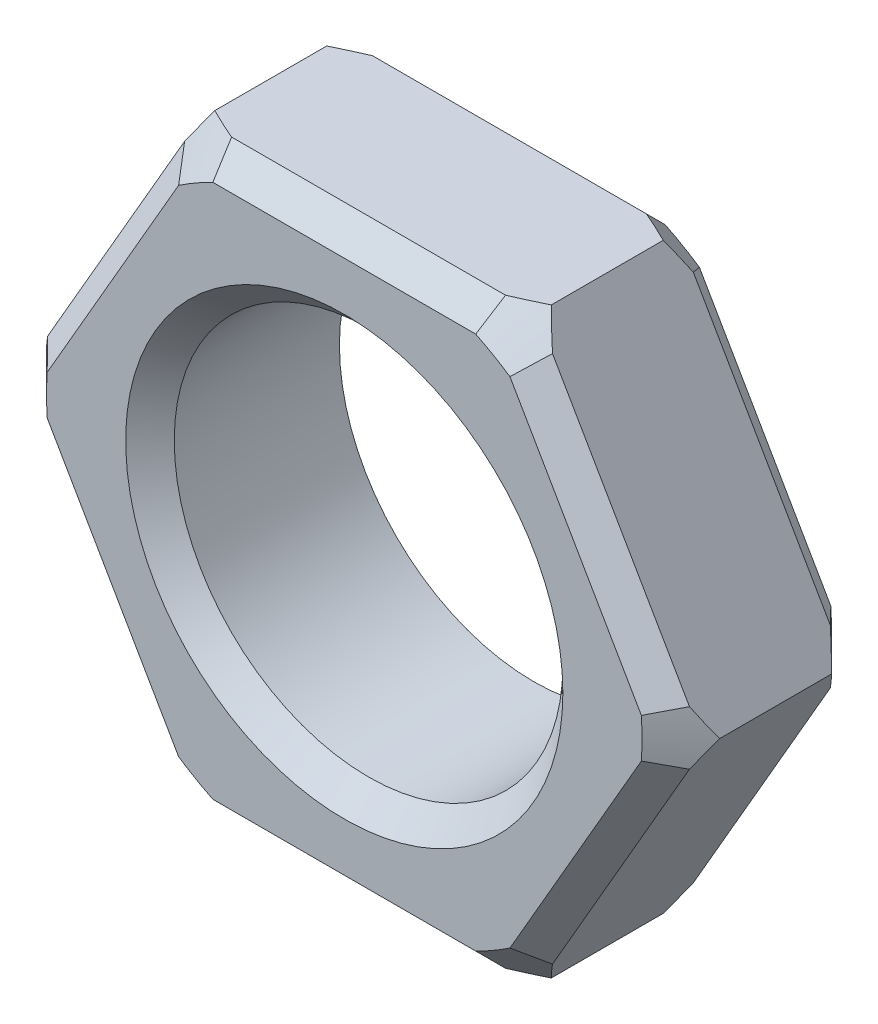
ISO-10303-21;
HEADER;
FILE_DESCRIPTION(('STEP AP214'),'2;1');
FILE_NAME('part.step','',(''),(''),'','','');
FILE_SCHEMA(('AUTOMOTIVE_DESIGN { 1 0 10303 214 1 1 1 1 }'));
ENDSEC;
DATA;
#1=APPLICATION_CONTEXT('core data for automotive mechanical design processes');
#2=APPLICATION_PROTOCOL_DEFINITION('international standard','automotive_design',2000,#1);
#3=PRODUCT_CONTEXT('',#1,'mechanical');
#4=PRODUCT('Part','Part','',(#3));
#5=PRODUCT_RELATED_PRODUCT_CATEGORY('part','',(#4));
#6=PRODUCT_DEFINITION_FORMATION('','',#4);
#7=PRODUCT_DEFINITION_CONTEXT('part definition',#1,'design');
#8=PRODUCT_DEFINITION('design','',#6,#7);
#9=PRODUCT_DEFINITION_SHAPE('','',#8);
#10=(LENGTH_UNIT() NAMED_UNIT(*) SI_UNIT(.MILLI.,.METRE.));
#11=(NAMED_UNIT(*) PLANE_ANGLE_UNIT() SI_UNIT($,.RADIAN.));
#12=(NAMED_UNIT(*) SI_UNIT($,.STERADIAN.) SOLID_ANGLE_UNIT());
#13=UNCERTAINTY_MEASURE_WITH_UNIT(LENGTH_MEASURE(1.E-05),#10,'distance_accuracy_value','');
#14=(GEOMETRIC_REPRESENTATION_CONTEXT(3) GLOBAL_UNCERTAINTY_ASSIGNED_CONTEXT((#13)) GLOBAL_UNIT_ASSIGNED_CONTEXT((#10,
#11,#12)) REPRESENTATION_CONTEXT('',''));
#15=CARTESIAN_POINT('',(0.,0.,0.));
#16=DIRECTION('',(0.,0.,1.));
#17=DIRECTION('',(1.,0.,0.));
#18=AXIS2_PLACEMENT_3D('',#15,#16,#17);
#19=CARTESIAN_POINT('',(0.,0.,7.8));
#20=DIRECTION('',(0.,0.,1.));
#21=DIRECTION('',(1.,0.,0.));
#22=AXIS2_PLACEMENT_3D('',#19,#20,#21);
#23=PLANE('',#22);
#24=CARTESIAN_POINT('',(0.,0.,7.8));
#25=DIRECTION('',(0.,0.,1.));
#26=DIRECTION('',(1.,0.,0.));
#27=AXIS2_PLACEMENT_3D('',#24,#25,#26);
#28=CIRCLE('',#27,9.00000000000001);
#29=CARTESIAN_POINT('',(9.00000000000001,0.,7.8));
#30=VERTEX_POINT('',#29);
#31=EDGE_CURVE('E245',#30,#30,#28,.F.);
#32=ORIENTED_EDGE('',*,*,#31,.T.);
#33=EDGE_LOOP('',(#32));
#34=FACE_BOUND('',#33,.T.);
#35=CARTESIAN_POINT('',(0.,0.,7.8));
#36=DIRECTION('',(0.,0.,1.));
#37=DIRECTION('',(1.,0.,0.));
#38=AXIS2_PLACEMENT_3D('',#35,#36,#37);
#39=CIRCLE('',#38,12.2591238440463);
#40=CARTESIAN_POINT('',(6.82044697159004,-10.1866393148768,7.8));
#41=VERTEX_POINT('',#40);
#42=CARTESIAN_POINT('',(5.41166494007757,-11.,7.8));
#43=VERTEX_POINT('',#42);
#44=EDGE_CURVE('E599',#41,#43,#39,.F.);
#45=ORIENTED_EDGE('',*,*,#44,.F.);
#46=DIRECTION('',(0.5,0.866025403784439,0.));
#47=VECTOR('',#46,1.);
#48=CARTESIAN_POINT('',(12.9903810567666,0.5,7.8));
#49=LINE('',#48,#47);
#50=CARTESIAN_POINT('',(12.2321119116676,-0.813360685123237,7.8));
#51=VERTEX_POINT('',#50);
#52=EDGE_CURVE('E584',#41,#51,#49,.T.);
#53=ORIENTED_EDGE('',*,*,#52,.T.);
#54=CARTESIAN_POINT('',(12.2321119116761,0.813360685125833,7.79999999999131));
#55=VERTEX_POINT('',#54);
#56=EDGE_CURVE('E259',#55,#51,#39,.F.);
#57=ORIENTED_EDGE('',*,*,#56,.F.);
#58=DIRECTION('',(-0.5,0.866025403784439,0.));
#59=VECTOR('',#58,1.);
#60=CARTESIAN_POINT('',(6.06217782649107,11.5,7.8));
#61=LINE('',#60,#59);
#62=CARTESIAN_POINT('',(6.82044697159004,10.1866393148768,7.8));
#63=VERTEX_POINT('',#62);
#64=EDGE_CURVE('E266',#55,#63,#61,.T.);
#65=ORIENTED_EDGE('',*,*,#64,.T.);
#66=CARTESIAN_POINT('',(5.41166494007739,10.9999999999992,7.80000000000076));
#67=VERTEX_POINT('',#66);
#68=EDGE_CURVE('E589',#67,#63,#39,.F.);
#69=ORIENTED_EDGE('',*,*,#68,.F.);
#70=DIRECTION('',(-1.,0.,0.));
#71=VECTOR('',#70,1.);
#72=CARTESIAN_POINT('',(-6.92820323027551,11.,7.8));
#73=LINE('',#72,#71);
#74=CARTESIAN_POINT('',(-5.41166494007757,11.,7.8));
#75=VERTEX_POINT('',#74);
#76=EDGE_CURVE('E255',#67,#75,#73,.T.);
#77=ORIENTED_EDGE('',*,*,#76,.T.);
#78=CARTESIAN_POINT('',(-6.82044697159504,10.1866393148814,7.79999999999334));
#79=VERTEX_POINT('',#78);
#80=EDGE_CURVE('E236',#79,#75,#39,.F.);
#81=ORIENTED_EDGE('',*,*,#80,.F.);
#82=DIRECTION('',(-0.5,-0.866025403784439,0.));
#83=VECTOR('',#82,1.);
#84=CARTESIAN_POINT('',(-12.9903810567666,-0.499999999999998,7.8));
#85=LINE('',#84,#83);
#86=CARTESIAN_POINT('',(-12.2321119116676,0.813360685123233,7.8));
#87=VERTEX_POINT('',#86);
#88=EDGE_CURVE('E252',#79,#87,#85,.T.);
#89=ORIENTED_EDGE('',*,*,#88,.T.);
#90=CARTESIAN_POINT('',(-12.2321119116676,-0.813360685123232,7.8));
#91=VERTEX_POINT('',#90);
#92=EDGE_CURVE('E260',#91,#87,#39,.F.);
#93=ORIENTED_EDGE('',*,*,#92,.F.);
#94=DIRECTION('',(0.5,-0.866025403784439,0.));
#95=VECTOR('',#94,1.);
#96=CARTESIAN_POINT('',(-6.06217782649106,-11.5,7.8));
#97=LINE('',#96,#95);
#98=CARTESIAN_POINT('',(-6.82044697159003,-10.1866393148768,7.8));
#99=VERTEX_POINT('',#98);
#100=EDGE_CURVE('E578',#91,#99,#97,.T.);
#101=ORIENTED_EDGE('',*,*,#100,.T.);
#102=CARTESIAN_POINT('',(-5.41166494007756,-11.,7.8));
#103=VERTEX_POINT('',#102);
#104=EDGE_CURVE('E598',#103,#99,#39,.F.);
#105=ORIENTED_EDGE('',*,*,#104,.F.);
#106=DIRECTION('',(1.,0.,0.));
#107=VECTOR('',#106,1.);
#108=CARTESIAN_POINT('',(6.92820323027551,-11.,7.8));
#109=LINE('',#108,#107);
#110=EDGE_CURVE('E581',#103,#43,#109,.T.);
#111=ORIENTED_EDGE('',*,*,#110,.T.);
#112=EDGE_LOOP('',(#45,#53,#57,#65,#69,#77,#81,#89,#93,#101,#105,#111));
#113=FACE_BOUND('',#112,.T.);
#114=ADVANCED_FACE('F32',(#34,#113),#23,.T.);
#115=CARTESIAN_POINT('',(0.,0.,0.));
#116=DIRECTION('',(0.,0.,1.));
#117=DIRECTION('',(1.,0.,0.));
#118=AXIS2_PLACEMENT_3D('',#115,#116,#117);
#119=PLANE('',#118);
#120=CARTESIAN_POINT('',(0.,0.,0.));
#121=DIRECTION('',(0.,0.,1.));
#122=DIRECTION('',(1.,0.,0.));
#123=AXIS2_PLACEMENT_3D('',#120,#121,#122);
#124=CIRCLE('',#123,8.);
#125=CARTESIAN_POINT('',(8.,0.,0.));
#126=VERTEX_POINT('',#125);
#127=EDGE_CURVE('E775',#126,#126,#124,.T.);
#128=ORIENTED_EDGE('',*,*,#127,.T.);
#129=EDGE_LOOP('',(#128));
#130=FACE_BOUND('',#129,.T.);
#131=DIRECTION('',(-0.5,-0.866025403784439,0.));
#132=VECTOR('',#131,1.);
#133=CARTESIAN_POINT('',(9.52627944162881,-5.49999999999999,0.));
#134=LINE('',#133,#132);
#135=CARTESIAN_POINT('',(12.2321119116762,-0.813360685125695,8.68762534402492E-12));
#136=VERTEX_POINT('',#135);
#137=CARTESIAN_POINT('',(6.82044697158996,-10.1866393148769,0.));
#138=VERTEX_POINT('',#137);
#139=EDGE_CURVE('E651',#136,#138,#134,.T.);
#140=ORIENTED_EDGE('',*,*,#139,.T.);
#141=CARTESIAN_POINT('',(0.,0.,0.));
#142=DIRECTION('',(0.,0.,1.));
#143=DIRECTION('',(1.,0.,0.));
#144=AXIS2_PLACEMENT_3D('',#141,#142,#143);
#145=CIRCLE('',#144,12.2591238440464);
#146=CARTESIAN_POINT('',(5.41166494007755,-10.9999999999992,-7.56763262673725E-13));
#147=VERTEX_POINT('',#146);
#148=EDGE_CURVE('E782',#138,#147,#145,.F.);
#149=ORIENTED_EDGE('',*,*,#148,.T.);
#150=DIRECTION('',(-1.,0.,0.));
#151=VECTOR('',#150,1.);
#152=CARTESIAN_POINT('',(0.,-11.,0.));
#153=LINE('',#152,#151);
#154=CARTESIAN_POINT('',(-5.41166494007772,-11.,0.));
#155=VERTEX_POINT('',#154);
#156=EDGE_CURVE('E654',#147,#155,#153,.T.);
#157=ORIENTED_EDGE('',*,*,#156,.T.);
#158=CARTESIAN_POINT('',(-6.82044697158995,-10.1866393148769,0.));
#159=VERTEX_POINT('',#158);
#160=EDGE_CURVE('E526',#155,#159,#145,.F.);
#161=ORIENTED_EDGE('',*,*,#160,.T.);
#162=DIRECTION('',(-0.5,0.866025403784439,0.));
#163=VECTOR('',#162,1.);
#164=CARTESIAN_POINT('',(-9.52627944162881,-5.49999999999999,0.));
#165=LINE('',#164,#163);
#166=CARTESIAN_POINT('',(-12.2321119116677,-0.813360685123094,0.));
#167=VERTEX_POINT('',#166);
#168=EDGE_CURVE('E639',#159,#167,#165,.T.);
#169=ORIENTED_EDGE('',*,*,#168,.T.);
#170=CARTESIAN_POINT('',(-12.2321119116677,0.813360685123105,0.));
#171=VERTEX_POINT('',#170);
#172=EDGE_CURVE('E788',#167,#171,#145,.F.);
#173=ORIENTED_EDGE('',*,*,#172,.T.);
#174=DIRECTION('',(0.5,0.866025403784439,0.));
#175=VECTOR('',#174,1.);
#176=CARTESIAN_POINT('',(-9.52627944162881,5.49999999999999,0.));
#177=LINE('',#176,#175);
#178=CARTESIAN_POINT('',(-6.82044697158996,10.1866393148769,0.));
#179=VERTEX_POINT('',#178);
#180=EDGE_CURVE('E642',#171,#179,#177,.T.);
#181=ORIENTED_EDGE('',*,*,#180,.T.);
#182=CARTESIAN_POINT('',(-5.41166494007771,11.,0.));
#183=VERTEX_POINT('',#182);
#184=EDGE_CURVE('E53',#179,#183,#145,.F.);
#185=ORIENTED_EDGE('',*,*,#184,.T.);
#186=DIRECTION('',(1.,0.,0.));
#187=VECTOR('',#186,1.);
#188=CARTESIAN_POINT('',(0.,11.,0.));
#189=LINE('',#188,#187);
#190=CARTESIAN_POINT('',(5.41166494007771,11.,0.));
#191=VERTEX_POINT('',#190);
#192=EDGE_CURVE('E645',#183,#191,#189,.T.);
#193=ORIENTED_EDGE('',*,*,#192,.T.);
#194=CARTESIAN_POINT('',(6.82044697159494,10.1866393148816,6.66368006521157E-12));
#195=VERTEX_POINT('',#194);
#196=EDGE_CURVE('E781',#191,#195,#145,.F.);
#197=ORIENTED_EDGE('',*,*,#196,.T.);
#198=DIRECTION('',(0.5,-0.866025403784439,0.));
#199=VECTOR('',#198,1.);
#200=CARTESIAN_POINT('',(9.52627944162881,5.49999999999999,0.));
#201=LINE('',#200,#199);
#202=CARTESIAN_POINT('',(12.2321119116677,0.813360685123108,0.));
#203=VERTEX_POINT('',#202);
#204=EDGE_CURVE('E648',#195,#203,#201,.T.);
#205=ORIENTED_EDGE('',*,*,#204,.T.);
#206=EDGE_CURVE('E480',#203,#136,#145,.F.);
#207=ORIENTED_EDGE('',*,*,#206,.T.);
#208=EDGE_LOOP('',(#140,#149,#157,#161,#169,#173,#181,#185,#193,#197,#205,#207));
#209=FACE_BOUND('',#208,.T.);
#210=ADVANCED_FACE('F417',(#130,#209),#119,.F.);
#211=CARTESIAN_POINT('',(-13.856406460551,0.,7.8));
#212=DIRECTION('',(0.866025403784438,0.5,0.));
#213=DIRECTION('',(-0.5,0.866025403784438,0.));
#214=AXIS2_PLACEMENT_3D('',#211,#212,#213);
#215=PLANE('',#214);
#216=DIRECTION('',(0.,0.,-1.));
#217=VECTOR('',#216,1.);
#218=CARTESIAN_POINT('',(-13.856406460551,0.,7.8));
#219=LINE('',#218,#217);
#220=CARTESIAN_POINT('',(-13.856406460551,0.,6.20271738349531));
#221=VERTEX_POINT('',#220);
#222=CARTESIAN_POINT('',(-13.856406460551,0.,1.59728261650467));
#223=VERTEX_POINT('',#222);
#224=EDGE_CURVE('E558',#221,#223,#219,.T.);
#225=ORIENTED_EDGE('',*,*,#224,.T.);
#226=CARTESIAN_POINT('',(-18.6690056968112,8.33566639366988,8.18629392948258));
#227=CARTESIAN_POINT('',(-18.5044246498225,8.05060365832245,7.91982341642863));
#228=CARTESIAN_POINT('',(-18.3391854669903,7.76440099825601,7.65496389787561));
#229=CARTESIAN_POINT('',(-18.007161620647,7.18931882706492,7.12908711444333));
#230=CARTESIAN_POINT('',(-17.8403768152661,6.90043907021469,6.86807020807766));
#231=CARTESIAN_POINT('',(-17.504652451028,6.31894741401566,6.34991499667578));
#232=CARTESIAN_POINT('',(-17.3357086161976,6.02632810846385,6.09278775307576));
#233=CARTESIAN_POINT('',(-16.9958087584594,5.43760428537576,5.58392043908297));
#234=CARTESIAN_POINT('',(-16.8248527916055,5.1414998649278,5.33218021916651));
#235=CARTESIAN_POINT('',(-16.4757724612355,4.5368749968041,4.8281322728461));
#236=CARTESIAN_POINT('',(-16.2975817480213,4.22823962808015,4.57600789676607));
#237=CARTESIAN_POINT('',(-15.9383557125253,3.60604188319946,4.08000598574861));
#238=CARTESIAN_POINT('',(-15.7573205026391,3.29247970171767,3.83612812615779));
#239=CARTESIAN_POINT('',(-15.3921013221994,2.65990152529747,3.35867074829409));
#240=CARTESIAN_POINT('',(-15.2079202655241,2.34089057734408,3.12508234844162));
#241=CARTESIAN_POINT('',(-14.8357604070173,1.6962907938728,2.67038932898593));
#242=CARTESIAN_POINT('',(-14.6477821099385,1.37070283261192,2.44928306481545));
#243=CARTESIAN_POINT('',(-14.264393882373,0.706654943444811,2.01917843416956));
#244=CARTESIAN_POINT('',(-14.0689131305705,0.368072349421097,1.81043090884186));
#245=CARTESIAN_POINT('',(-13.6728152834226,-0.317989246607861,1.41309502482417));
#246=CARTESIAN_POINT('',(-13.4721974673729,-0.665469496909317,1.22450951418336));
#247=CARTESIAN_POINT('',(-13.0665242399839,-1.36811613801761,0.873764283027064));
#248=CARTESIAN_POINT('',(-12.8614994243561,-1.72322953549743,0.711464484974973));
#249=CARTESIAN_POINT('',(-12.4458726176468,-2.44311628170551,0.418319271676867));
#250=CARTESIAN_POINT('',(-12.2352723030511,-2.8078867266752,0.28746451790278));
#251=CARTESIAN_POINT('',(-11.8498322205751,-3.47548853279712,0.0853875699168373));
#252=CARTESIAN_POINT('',(-11.6758651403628,-3.77680835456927,0.00754497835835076));
#253=CARTESIAN_POINT('',(-11.3253401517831,-4.38393544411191,-0.119785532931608));
#254=CARTESIAN_POINT('',(-11.1487826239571,-4.6897420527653,-0.169277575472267));
#255=CARTESIAN_POINT('',(-10.7944613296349,-5.30344453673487,-0.237360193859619));
#256=CARTESIAN_POINT('',(-10.6167000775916,-5.61133605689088,-0.256002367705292));
#257=CARTESIAN_POINT('',(-10.2610492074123,-6.22734143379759,-0.261522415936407));
#258=CARTESIAN_POINT('',(-10.0831595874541,-6.53545529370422,-0.248399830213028));
#259=CARTESIAN_POINT('',(-9.7291604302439,-7.14859981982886,-0.191197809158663));
#260=CARTESIAN_POINT('',(-9.55304726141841,-7.45363677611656,-0.147206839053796));
#261=CARTESIAN_POINT('',(-9.20322512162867,-8.05954649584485,-0.030609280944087));
#262=CARTESIAN_POINT('',(-9.02951634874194,-8.36041891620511,0.0419996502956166));
#263=CARTESIAN_POINT('',(-8.68476837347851,-8.95753992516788,0.21287479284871));
#264=CARTESIAN_POINT('',(-8.51373873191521,-9.25377195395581,0.311217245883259));
#265=CARTESIAN_POINT('',(-8.17527793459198,-9.8400032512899,0.529863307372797));
#266=CARTESIAN_POINT('',(-8.00784659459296,-10.1300028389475,0.650165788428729));
#267=CARTESIAN_POINT('',(-7.61491614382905,-10.8105783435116,0.957544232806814));
#268=CARTESIAN_POINT('',(-7.39102250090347,-11.1983735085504,1.15279937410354));
#269=CARTESIAN_POINT('',(-6.94960432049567,-11.9629322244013,1.57045915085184));
#270=CARTESIAN_POINT('',(-6.73208347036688,-12.3396893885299,1.79287913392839));
#271=CARTESIAN_POINT('',(-6.30232588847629,-13.0840513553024,2.25917979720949));
#272=CARTESIAN_POINT('',(-6.09010115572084,-13.4516353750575,2.5031043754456));
#273=CARTESIAN_POINT('',(-5.67065152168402,-14.1781434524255,3.00730061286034));
#274=CARTESIAN_POINT('',(-5.4634256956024,-14.5370691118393,3.26756921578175));
#275=CARTESIAN_POINT('',(-5.05226921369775,-15.2492130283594,3.80219413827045));
#276=CARTESIAN_POINT('',(-4.8483574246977,-15.6023986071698,4.07660822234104));
#277=CARTESIAN_POINT('',(-4.444119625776,-16.3025590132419,4.63579937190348));
#278=CARTESIAN_POINT('',(-4.24379375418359,-16.6495336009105,4.92057683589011));
#279=CARTESIAN_POINT('',(-3.84639040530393,-17.3378563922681,5.49817245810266));
#280=CARTESIAN_POINT('',(-3.64930974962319,-17.6792101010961,5.79098189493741));
#281=CARTESIAN_POINT('',(-3.25772819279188,-18.3574492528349,6.38338534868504));
#282=CARTESIAN_POINT('',(-3.06322721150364,-18.6943348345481,6.68297915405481));
#283=CARTESIAN_POINT('',(-2.80641439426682,-19.1391476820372,7.0845238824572));
#284=CARTESIAN_POINT('',(-2.74312075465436,-19.2487754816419,7.183974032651));
#285=CARTESIAN_POINT('',(-2.61675462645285,-19.4676480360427,7.38344974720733));
#286=CARTESIAN_POINT('',(-2.55368215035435,-19.5768927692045,7.48347534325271));
#287=CARTESIAN_POINT('',(-2.42799078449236,-19.7945966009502,7.68368033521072));
#288=CARTESIAN_POINT('',(-2.36537108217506,-19.9030571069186,7.78385769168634));
#289=CARTESIAN_POINT('',(-2.24033699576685,-20.1196224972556,7.98470920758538));
#290=CARTESIAN_POINT('',(-2.17792260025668,-20.2277274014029,8.08538333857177));
#291=CARTESIAN_POINT('',(-2.11560399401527,-20.3356663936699,8.18629392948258));
#292=B_SPLINE_CURVE_WITH_KNOTS('',3,(#226,#227,#228,#229,#230,#231,#232,#233,#234,#235,#236,
#237,#238,#239,#240,#241,#242,#243,#244,#245,#246,#247,#248,#249,#250,#251,#252,#253,#254,#255,
#256,#257,#258,#259,#260,#261,#262,#263,#264,#265,#266,#267,#268,#269,#270,#271,#272,#273,#274,
#275,#276,#277,#278,#279,#280,#281,#282,#283,#284,#285,#286,#287,#288,#289,#290,#291),
.UNSPECIFIED.,.F.,.F.,(4,2,2,2,2,2,2,2,2,2,2,2,2,2,2,2,2,2,2,2,2,2,2,2,2,2,2,2,2,2,2,2,4),(0.,
1.27051585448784,2.54114950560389,3.81489426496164,5.08860362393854,6.39815301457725,
7.70765078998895,9.0159951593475,10.3241667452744,11.6533039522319,12.982628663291,
14.3046180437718,15.6262143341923,16.6947942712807,17.7632187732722,18.8298544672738,
19.8965056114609,20.9601122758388,22.0238060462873,23.0906876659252,24.1575145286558,
25.6217914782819,27.0868995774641,28.5550709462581,30.0229685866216,31.4974268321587,
32.9719418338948,34.4449146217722,35.9178415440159,36.400781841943,36.8837489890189,
37.3648752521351,37.84597428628),.UNSPECIFIED.);
#293=CARTESIAN_POINT('',(-13.2120727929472,-1.11601864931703,1.));
#294=VERTEX_POINT('',#293);
#295=EDGE_CURVE('E527',#223,#294,#292,.T.);
#296=ORIENTED_EDGE('',*,*,#295,.T.);
#297=DIRECTION('',(0.5,-0.866025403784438,0.));
#298=VECTOR('',#297,1.);
#299=CARTESIAN_POINT('',(-13.856406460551,0.,1.));
#300=LINE('',#299,#298);
#301=CARTESIAN_POINT('',(-7.57253689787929,-10.883981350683,0.999999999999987));
#302=VERTEX_POINT('',#301);
#303=EDGE_CURVE('E572',#294,#302,#300,.T.);
#304=ORIENTED_EDGE('',*,*,#303,.T.);
#305=CARTESIAN_POINT('',(-6.92820323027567,-12.,1.59728261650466));
#306=VERTEX_POINT('',#305);
#307=EDGE_CURVE('E521',#302,#306,#292,.T.);
#308=ORIENTED_EDGE('',*,*,#307,.T.);
#309=DIRECTION('',(0.,0.,-1.));
#310=VECTOR('',#309,1.);
#311=CARTESIAN_POINT('',(-6.9282032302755,-12.,7.8));
#312=LINE('',#311,#310);
#313=CARTESIAN_POINT('',(-6.9282032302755,-12.,6.20271738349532));
#314=VERTEX_POINT('',#313);
#315=EDGE_CURVE('E626',#314,#306,#312,.T.);
#316=ORIENTED_EDGE('',*,*,#315,.F.);
#317=CARTESIAN_POINT('',(-2.11560399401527,-20.3356663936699,-0.38629392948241));
#318=CARTESIAN_POINT('',(-2.28018504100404,-20.0506036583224,-0.119823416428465));
#319=CARTESIAN_POINT('',(-2.44542422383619,-19.764400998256,0.145036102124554));
#320=CARTESIAN_POINT('',(-2.77744807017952,-19.1893188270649,0.670912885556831));
#321=CARTESIAN_POINT('',(-2.94423287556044,-18.9004390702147,0.931929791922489));
#322=CARTESIAN_POINT('',(-3.27995723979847,-18.3189474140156,1.45008500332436));
#323=CARTESIAN_POINT('',(-3.4489010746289,-18.0263281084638,1.70721224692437));
#324=CARTESIAN_POINT('',(-3.78880093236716,-17.4376042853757,2.21607956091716));
#325=CARTESIAN_POINT('',(-3.95975689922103,-17.1414998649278,2.46781978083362));
#326=CARTESIAN_POINT('',(-4.30883722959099,-16.536874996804,2.97186772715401));
#327=CARTESIAN_POINT('',(-4.4870279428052,-16.2282396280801,3.22399210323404));
#328=CARTESIAN_POINT('',(-4.84625397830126,-15.6060418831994,3.71999401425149));
#329=CARTESIAN_POINT('',(-5.02728918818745,-15.2924797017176,3.96387187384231));
#330=CARTESIAN_POINT('',(-5.39250836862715,-14.6599015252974,4.441329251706));
#331=CARTESIAN_POINT('',(-5.57668942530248,-14.340890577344,4.67491765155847));
#332=CARTESIAN_POINT('',(-5.94884928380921,-13.6962907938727,5.12961067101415));
#333=CARTESIAN_POINT('',(-6.13682758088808,-13.3707028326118,5.35071693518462));
#334=CARTESIAN_POINT('',(-6.52021580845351,-12.7066549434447,5.78082156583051));
#335=CARTESIAN_POINT('',(-6.71569656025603,-12.368072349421,5.9895690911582));
#336=CARTESIAN_POINT('',(-7.11179440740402,-11.682010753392,6.38690497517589));
#337=CARTESIAN_POINT('',(-7.31241222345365,-11.3345305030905,6.57549048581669));
#338=CARTESIAN_POINT('',(-7.71808545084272,-10.6318838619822,6.92623571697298));
#339=CARTESIAN_POINT('',(-7.92311026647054,-10.2767704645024,7.08853551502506));
#340=CARTESIAN_POINT('',(-8.33873707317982,-9.55688371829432,7.38168072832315));
#341=CARTESIAN_POINT('',(-8.5493373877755,-9.19211327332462,7.51253548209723));
#342=CARTESIAN_POINT('',(-8.93477747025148,-8.52451146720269,7.71461243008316));
#343=CARTESIAN_POINT('',(-9.10874455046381,-8.22319164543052,7.79245502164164));
#344=CARTESIAN_POINT('',(-9.45926953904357,-7.61606455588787,7.91978553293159));
#345=CARTESIAN_POINT('',(-9.63582706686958,-7.31025794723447,7.96927757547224));
#346=CARTESIAN_POINT('',(-9.99014836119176,-6.69655546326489,8.03736019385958));
#347=CARTESIAN_POINT('',(-10.167909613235,-6.38866394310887,8.05600236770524));
#348=CARTESIAN_POINT('',(-10.5235604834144,-5.77265856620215,8.06152241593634));
#349=CARTESIAN_POINT('',(-10.7014501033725,-5.46454470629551,8.04839983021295));
#350=CARTESIAN_POINT('',(-11.0554492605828,-4.85140018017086,7.99119780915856));
#351=CARTESIAN_POINT('',(-11.2315624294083,-4.54636322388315,7.94720683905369));
#352=CARTESIAN_POINT('',(-11.581384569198,-3.94045350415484,7.83060928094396));
#353=CARTESIAN_POINT('',(-11.7550933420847,-3.63958108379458,7.75800034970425));
#354=CARTESIAN_POINT('',(-12.0998413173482,-3.0424600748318,7.58712520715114));
#355=CARTESIAN_POINT('',(-12.2708709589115,-2.74622804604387,7.48878275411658));
#356=CARTESIAN_POINT('',(-12.6093317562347,-2.15999674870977,7.27013669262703));
#357=CARTESIAN_POINT('',(-12.7767630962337,-1.86999716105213,7.14983421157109));
#358=CARTESIAN_POINT('',(-13.1696935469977,-1.18942165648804,6.84245576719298));
#359=CARTESIAN_POINT('',(-13.3935871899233,-0.80162649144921,6.64720062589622));
#360=CARTESIAN_POINT('',(-13.8350053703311,-0.0370677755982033,6.22954084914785));
#361=CARTESIAN_POINT('',(-14.0525262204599,0.339689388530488,6.00712086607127));
#362=CARTESIAN_POINT('',(-14.4822838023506,1.08405135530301,5.54082020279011));
#363=CARTESIAN_POINT('',(-14.6945085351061,1.45163537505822,5.29689562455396));
#364=CARTESIAN_POINT('',(-15.1139581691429,2.17814345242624,4.79269938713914));
#365=CARTESIAN_POINT('',(-15.3211839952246,2.53706911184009,4.5324307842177));
#366=CARTESIAN_POINT('',(-15.7323404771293,3.24921302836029,3.99780586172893));
#367=CARTESIAN_POINT('',(-15.9362522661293,3.60239860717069,3.7233917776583));
#368=CARTESIAN_POINT('',(-16.3404900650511,4.30255901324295,3.16420062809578));
#369=CARTESIAN_POINT('',(-16.5408159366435,4.64953360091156,2.87942316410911));
#370=CARTESIAN_POINT('',(-16.9382192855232,5.33785639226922,2.30182754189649));
#371=CARTESIAN_POINT('',(-17.135299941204,5.6792101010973,2.0090181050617));
#372=CARTESIAN_POINT('',(-17.5268814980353,6.35744925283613,1.41661465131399));
#373=CARTESIAN_POINT('',(-17.7213824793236,6.69433483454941,1.11702084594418));
#374=CARTESIAN_POINT('',(-17.9781952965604,7.13914768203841,0.715476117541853));
#375=CARTESIAN_POINT('',(-18.0414889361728,7.24877548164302,0.616025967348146));
#376=CARTESIAN_POINT('',(-18.1678550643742,7.46764803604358,0.416550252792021));
#377=CARTESIAN_POINT('',(-18.2309275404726,7.57689276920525,0.316524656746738));
#378=CARTESIAN_POINT('',(-18.3566189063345,7.79459660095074,0.116319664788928));
#379=CARTESIAN_POINT('',(-18.4192386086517,7.90305710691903,0.0161423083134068));
#380=CARTESIAN_POINT('',(-18.5442726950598,8.11962249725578,-0.184709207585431));
#381=CARTESIAN_POINT('',(-18.6066870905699,8.22772740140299,-0.285383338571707));
#382=CARTESIAN_POINT('',(-18.6690056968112,8.33566639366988,-0.38629392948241));
#383=B_SPLINE_CURVE_WITH_KNOTS('',3,(#317,#318,#319,#320,#321,#322,#323,#324,#325,#326,#327,
#328,#329,#330,#331,#332,#333,#334,#335,#336,#337,#338,#339,#340,#341,#342,#343,#344,#345,#346,
#347,#348,#349,#350,#351,#352,#353,#354,#355,#356,#357,#358,#359,#360,#361,#362,#363,#364,#365,
#366,#367,#368,#369,#370,#371,#372,#373,#374,#375,#376,#377,#378,#379,#380,#381,#382),
.UNSPECIFIED.,.F.,.F.,(4,2,2,2,2,2,2,2,2,2,2,2,2,2,2,2,2,2,2,2,2,2,2,2,2,2,2,2,2,2,2,2,4),(0.,
1.27051585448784,2.5411495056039,3.81489426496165,5.08860362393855,6.39815301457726,
7.70765078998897,9.01599515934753,10.3241667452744,11.653303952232,12.9826286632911,
14.3046180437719,15.6262143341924,16.6947942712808,17.7632187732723,18.8298544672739,
19.8965056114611,20.960112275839,22.0238060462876,23.0906876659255,24.1575145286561,
25.6217914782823,27.0868995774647,28.5550709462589,30.0229685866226,31.4974268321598,
32.9719418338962,34.4449146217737,35.9178415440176,36.4007818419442,36.8837489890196,
37.3648752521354,37.8459742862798),.UNSPECIFIED.);
#384=CARTESIAN_POINT('',(-7.57253689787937,-10.8839813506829,6.8));
#385=VERTEX_POINT('',#384);
#386=EDGE_CURVE('E601',#314,#385,#383,.T.);
#387=ORIENTED_EDGE('',*,*,#386,.T.);
#388=DIRECTION('',(-0.5,0.866025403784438,0.));
#389=VECTOR('',#388,1.);
#390=CARTESIAN_POINT('',(-13.856406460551,0.,6.8));
#391=LINE('',#390,#389);
#392=CARTESIAN_POINT('',(-13.2120727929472,-1.11601864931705,6.80000000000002));
#393=VERTEX_POINT('',#392);
#394=EDGE_CURVE('E563',#385,#393,#391,.T.);
#395=ORIENTED_EDGE('',*,*,#394,.T.);
#396=EDGE_CURVE('E313',#393,#221,#383,.T.);
#397=ORIENTED_EDGE('',*,*,#396,.T.);
#398=EDGE_LOOP('',(#225,#296,#304,#308,#316,#387,#395,#397));
#399=FACE_BOUND('',#398,.T.);
#400=ADVANCED_FACE('F423',(#399),#215,.F.);
#401=CARTESIAN_POINT('',(-6.9282032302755,-12.,7.8));
#402=DIRECTION('',(0.,1.,0.));
#403=DIRECTION('',(-1.,0.,0.));
#404=AXIS2_PLACEMENT_3D('',#401,#402,#403);
#405=PLANE('',#404);
#406=ORIENTED_EDGE('',*,*,#315,.T.);
#407=CARTESIAN_POINT('',(-15.2638696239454,-12.,7.15699615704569));
#408=CARTESIAN_POINT('',(-14.9206139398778,-12.,6.88719607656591));
#409=CARTESIAN_POINT('',(-14.5757012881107,-12.,6.61947682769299));
#410=CARTESIAN_POINT('',(-13.8819194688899,-12.,6.08909617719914));
#411=CARTESIAN_POINT('',(-13.5330496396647,-12.,5.82643564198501));
#412=CARTESIAN_POINT('',(-12.8290170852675,-12.,5.30582243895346));
#413=CARTESIAN_POINT('',(-12.473831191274,-12.,5.04790101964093));
#414=CARTESIAN_POINT('',(-11.7582190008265,-12.,4.53945576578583));
#415=CARTESIAN_POINT('',(-11.3977929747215,-12.,4.28893155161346));
#416=CARTESIAN_POINT('',(-10.6526677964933,-12.,3.78457796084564));
#417=CARTESIAN_POINT('',(-10.2676557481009,-12.,3.53120907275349));
#418=CARTESIAN_POINT('',(-9.48971363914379,-12.,3.03677242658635));
#419=CARTESIAN_POINT('',(-9.09678268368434,-12.,2.79570606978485));
#420=CARTESIAN_POINT('',(-8.30256606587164,-12.,2.32955036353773));
#421=CARTESIAN_POINT('',(-7.9012988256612,-12.,2.10442981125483));
#422=CARTESIAN_POINT('',(-7.08842843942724,-12.,1.67382269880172));
#423=CARTESIAN_POINT('',(-6.67682856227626,-12.,1.46833002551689));
#424=CARTESIAN_POINT('',(-5.88578667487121,-12.,1.10249346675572));
#425=CARTESIAN_POINT('',(-5.50749774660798,-12.,0.93967482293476));
#426=CARTESIAN_POINT('',(-4.74107904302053,-12.,0.638692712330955));
#427=CARTESIAN_POINT('',(-4.35294832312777,-12.,0.500531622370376));
#428=CARTESIAN_POINT('',(-3.57172320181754,-12.,0.255721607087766));
#429=CARTESIAN_POINT('',(-3.17873979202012,-12.,0.148723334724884));
#430=CARTESIAN_POINT('',(-2.38485277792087,-12.,-0.0305434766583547));
#431=CARTESIAN_POINT('',(-1.98395022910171,-12.,-0.102816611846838));
#432=CARTESIAN_POINT('',(-1.16951886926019,-12.,-0.209144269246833));
#433=CARTESIAN_POINT('',(-0.755893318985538,-12.,-0.242473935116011));
#434=CARTESIAN_POINT('',(0.0725742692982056,-12.,-0.266048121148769));
#435=CARTESIAN_POINT('',(0.487416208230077,-12.,-0.256296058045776));
#436=CARTESIAN_POINT('',(1.31519745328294,-12.,-0.194350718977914));
#437=CARTESIAN_POINT('',(1.72812636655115,-12.,-0.142021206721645));
#438=CARTESIAN_POINT('',(2.54711311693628,-12.,0.00158458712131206));
#439=CARTESIAN_POINT('',(2.95316909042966,-12.,0.0928712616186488));
#440=CARTESIAN_POINT('',(3.88473849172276,-12.,0.34367193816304));
#441=CARTESIAN_POINT('',(4.40686319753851,-12.,0.515673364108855));
#442=CARTESIAN_POINT('',(5.43374897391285,-12.,0.905193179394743));
#443=CARTESIAN_POINT('',(5.93849916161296,-12.,1.1227395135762));
#444=CARTESIAN_POINT('',(6.93511209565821,-12.,1.59373066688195));
#445=CARTESIAN_POINT('',(7.42685838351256,-12.,1.84741860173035));
#446=CARTESIAN_POINT('',(8.39575918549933,-12.,2.38072873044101));
#447=CARTESIAN_POINT('',(8.87291717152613,-12.,2.66034468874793));
#448=CARTESIAN_POINT('',(9.86555154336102,-12.,3.27019440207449));
#449=CARTESIAN_POINT('',(10.3796582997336,-12.,3.60264196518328));
#450=CARTESIAN_POINT('',(11.3958690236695,-12.,4.28549228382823));
#451=CARTESIAN_POINT('',(11.8979706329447,-12.,4.63589852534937));
#452=CARTESIAN_POINT('',(12.6384287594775,-12.,5.16790734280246));
#453=CARTESIAN_POINT('',(12.8805331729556,-12.,5.34433349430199));
#454=CARTESIAN_POINT('',(13.3626131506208,-12.,5.70007801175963));
#455=CARTESIAN_POINT('',(13.6025886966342,-12.,5.87939640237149));
#456=CARTESIAN_POINT('',(14.0804581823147,-12.,6.24046563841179));
#457=CARTESIAN_POINT('',(14.3183533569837,-12.,6.42221485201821));
#458=CARTESIAN_POINT('',(14.7923846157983,-12.,6.78797587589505));
#459=CARTESIAN_POINT('',(15.0285207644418,-12.,6.97198760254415));
#460=CARTESIAN_POINT('',(15.2638696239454,-12.,7.1569961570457));
#461=B_SPLINE_CURVE_WITH_KNOTS('',3,(#407,#408,#409,#410,#411,#412,#413,#414,#415,#416,#417,
#418,#419,#420,#421,#422,#423,#424,#425,#426,#427,#428,#429,#430,#431,#432,#433,#434,#435,#436,
#437,#438,#439,#440,#441,#442,#443,#444,#445,#446,#447,#448,#449,#450,#451,#452,#453,#454,#455,
#456,#457,#458,#459,#460),.UNSPECIFIED.,.F.,.F.,(4,2,2,2,2,2,2,2,2,2,2,2,2,2,2,2,2,2,2,2,2,2,2,
2,2,2,4),(0.,1.30980660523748,2.61983558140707,3.93661766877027,5.25333206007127,
6.63584801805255,8.01852109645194,9.39840919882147,10.7778661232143,12.0126894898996,
13.247631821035,14.4681442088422,15.6884950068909,16.9312156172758,18.1738376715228,
19.4204514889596,20.6673980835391,22.3136779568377,23.9609709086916,25.6199196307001,
27.2784704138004,29.1146606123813,30.9512085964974,31.8498953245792,32.7485897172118,
33.6467084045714,34.5447939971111),.UNSPECIFIED.);
#462=CARTESIAN_POINT('',(-5.63953589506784,-12.,1.));
#463=VERTEX_POINT('',#462);
#464=EDGE_CURVE('E514',#306,#463,#461,.T.);
#465=ORIENTED_EDGE('',*,*,#464,.T.);
#466=DIRECTION('',(1.,0.,0.));
#467=VECTOR('',#466,1.);
#468=CARTESIAN_POINT('',(-6.9282032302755,-12.,1.));
#469=LINE('',#468,#467);
#470=CARTESIAN_POINT('',(5.63953589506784,-12.,1.));
#471=VERTEX_POINT('',#470);
#472=EDGE_CURVE('E637',#463,#471,#469,.T.);
#473=ORIENTED_EDGE('',*,*,#472,.T.);
#474=CARTESIAN_POINT('',(6.92820323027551,-12.,1.59728261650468));
#475=VERTEX_POINT('',#474);
#476=EDGE_CURVE('E608',#471,#475,#461,.T.);
#477=ORIENTED_EDGE('',*,*,#476,.T.);
#478=DIRECTION('',(0.,0.,-1.));
#479=VECTOR('',#478,1.);
#480=CARTESIAN_POINT('',(6.92820323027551,-12.,7.8));
#481=LINE('',#480,#479);
#482=CARTESIAN_POINT('',(6.92820323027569,-12.,6.20271738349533));
#483=VERTEX_POINT('',#482);
#484=EDGE_CURVE('E617',#483,#475,#481,.T.);
#485=ORIENTED_EDGE('',*,*,#484,.F.);
#486=CARTESIAN_POINT('',(15.2638696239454,-12.,0.643003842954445));
#487=CARTESIAN_POINT('',(14.9206139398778,-12.,0.912803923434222));
#488=CARTESIAN_POINT('',(14.5757012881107,-12.,1.18052317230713));
#489=CARTESIAN_POINT('',(13.8819194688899,-12.,1.71090382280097));
#490=CARTESIAN_POINT('',(13.5330496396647,-12.,1.9735643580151));
#491=CARTESIAN_POINT('',(12.8290170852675,-12.,2.49417756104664));
#492=CARTESIAN_POINT('',(12.473831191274,-12.,2.75209898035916));
#493=CARTESIAN_POINT('',(11.7582190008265,-12.,3.26054423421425));
#494=CARTESIAN_POINT('',(11.3977929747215,-12.,3.51106844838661));
#495=CARTESIAN_POINT('',(10.6526677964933,-12.,4.01542203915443));
#496=CARTESIAN_POINT('',(10.2676557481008,-12.,4.26879092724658));
#497=CARTESIAN_POINT('',(9.48971363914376,-12.,4.7632275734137));
#498=CARTESIAN_POINT('',(9.0967826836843,-12.,5.00429393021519));
#499=CARTESIAN_POINT('',(8.3025660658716,-12.,5.4704496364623));
#500=CARTESIAN_POINT('',(7.90129882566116,-12.,5.6955701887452));
#501=CARTESIAN_POINT('',(7.0884284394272,-12.,6.12617730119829));
#502=CARTESIAN_POINT('',(6.67682856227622,-12.,6.33166997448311));
#503=CARTESIAN_POINT('',(5.88578667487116,-12.,6.69750653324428));
#504=CARTESIAN_POINT('',(5.50749774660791,-12.,6.86032517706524));
#505=CARTESIAN_POINT('',(4.74107904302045,-12.,7.16130728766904));
#506=CARTESIAN_POINT('',(4.35294832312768,-12.,7.29946837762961));
#507=CARTESIAN_POINT('',(3.57172320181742,-12.,7.54427839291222));
#508=CARTESIAN_POINT('',(3.17873979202,-12.,7.6512766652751));
#509=CARTESIAN_POINT('',(2.38485277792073,-12.,7.83054347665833));
#510=CARTESIAN_POINT('',(1.98395022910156,-12.,7.90281661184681));
#511=CARTESIAN_POINT('',(1.16951886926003,-12.,8.00914426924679));
#512=CARTESIAN_POINT('',(0.755893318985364,-12.,8.04247393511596));
#513=CARTESIAN_POINT('',(-0.0725742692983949,-12.,8.0660481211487));
#514=CARTESIAN_POINT('',(-0.487416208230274,-12.,8.0562960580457));
#515=CARTESIAN_POINT('',(-1.31519745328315,-12.,7.99435071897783));
#516=CARTESIAN_POINT('',(-1.72812636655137,-12.,7.94202120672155));
#517=CARTESIAN_POINT('',(-2.54711311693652,-12.,7.79841541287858));
#518=CARTESIAN_POINT('',(-2.9531690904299,-12.,7.70712873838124));
#519=CARTESIAN_POINT('',(-3.88473849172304,-12.,7.45632806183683));
#520=CARTESIAN_POINT('',(-4.40686319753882,-12.,7.28432663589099));
#521=CARTESIAN_POINT('',(-5.43374897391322,-12.,6.89480682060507));
#522=CARTESIAN_POINT('',(-5.93849916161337,-12.,6.67726048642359));
#523=CARTESIAN_POINT('',(-6.93511209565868,-12.,6.2062693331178));
#524=CARTESIAN_POINT('',(-7.42685838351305,-12.,5.95258139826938));
#525=CARTESIAN_POINT('',(-8.39575918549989,-12.,5.41927126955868));
#526=CARTESIAN_POINT('',(-8.87291717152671,-12.,5.13965531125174));
#527=CARTESIAN_POINT('',(-9.86555154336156,-12.,4.52980559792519));
#528=CARTESIAN_POINT('',(-10.3796582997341,-12.,4.19735803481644));
#529=CARTESIAN_POINT('',(-11.3958690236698,-12.,3.51450771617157));
#530=CARTESIAN_POINT('',(-11.8979706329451,-12.,3.16410147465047));
#531=CARTESIAN_POINT('',(-12.6384287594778,-12.,2.63209265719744));
#532=CARTESIAN_POINT('',(-12.8805331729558,-12.,2.45566650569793));
#533=CARTESIAN_POINT('',(-13.3626131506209,-12.,2.09992198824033));
#534=CARTESIAN_POINT('',(-13.6025886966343,-12.,1.9206035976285));
#535=CARTESIAN_POINT('',(-14.0804581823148,-12.,1.55953436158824));
#536=CARTESIAN_POINT('',(-14.3183533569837,-12.,1.37778514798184));
#537=CARTESIAN_POINT('',(-14.7923846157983,-12.,1.01202412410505));
#538=CARTESIAN_POINT('',(-15.0285207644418,-12.,0.828012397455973));
#539=CARTESIAN_POINT('',(-15.2638696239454,-12.,0.643003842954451));
#540=B_SPLINE_CURVE_WITH_KNOTS('',3,(#486,#487,#488,#489,#490,#491,#492,#493,#494,#495,#496,
#497,#498,#499,#500,#501,#502,#503,#504,#505,#506,#507,#508,#509,#510,#511,#512,#513,#514,#515,
#516,#517,#518,#519,#520,#521,#522,#523,#524,#525,#526,#527,#528,#529,#530,#531,#532,#533,#534,
#535,#536,#537,#538,#539),.UNSPECIFIED.,.F.,.F.,(4,2,2,2,2,2,2,2,2,2,2,2,2,2,2,2,2,2,2,2,2,2,2,
2,2,2,4),(0.,1.30980660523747,2.61983558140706,3.93661766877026,5.25333206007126,
6.63584801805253,8.01852109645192,9.39840919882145,10.7778661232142,12.0126894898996,
13.247631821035,14.4681442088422,15.688495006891,16.9312156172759,18.1738376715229,
19.4204514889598,20.6673980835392,22.313677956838,23.960970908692,25.6199196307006,
27.278470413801,29.1146606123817,30.9512085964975,31.8498953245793,32.7485897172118,
33.6467084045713,34.5447939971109),.UNSPECIFIED.);
#541=CARTESIAN_POINT('',(5.63953589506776,-12.,6.8));
#542=VERTEX_POINT('',#541);
#543=EDGE_CURVE('E597',#483,#542,#540,.T.);
#544=ORIENTED_EDGE('',*,*,#543,.T.);
#545=DIRECTION('',(-1.,0.,0.));
#546=VECTOR('',#545,1.);
#547=CARTESIAN_POINT('',(-6.9282032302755,-12.,6.8));
#548=LINE('',#547,#546);
#549=CARTESIAN_POINT('',(-5.63953589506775,-12.,6.80000000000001));
#550=VERTEX_POINT('',#549);
#551=EDGE_CURVE('E629',#542,#550,#548,.T.);
#552=ORIENTED_EDGE('',*,*,#551,.T.);
#553=EDGE_CURVE('E339',#550,#314,#540,.T.);
#554=ORIENTED_EDGE('',*,*,#553,.T.);
#555=EDGE_LOOP('',(#406,#465,#473,#477,#485,#544,#552,#554));
#556=FACE_BOUND('',#555,.T.);
#557=ADVANCED_FACE('F502',(#556),#405,.F.);
#558=CARTESIAN_POINT('',(6.92820323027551,-12.,7.8));
#559=DIRECTION('',(-0.866025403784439,0.5,0.));
#560=DIRECTION('',(-0.5,-0.866025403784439,0.));
#561=AXIS2_PLACEMENT_3D('',#558,#559,#560);
#562=PLANE('',#561);
#563=ORIENTED_EDGE('',*,*,#484,.T.);
#564=CARTESIAN_POINT('',(2.1156039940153,-20.3356663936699,8.18629392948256));
#565=CARTESIAN_POINT('',(2.28018504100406,-20.0506036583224,7.91982341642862));
#566=CARTESIAN_POINT('',(2.44542422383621,-19.764400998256,7.65496389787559));
#567=CARTESIAN_POINT('',(2.77744807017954,-19.1893188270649,7.12908711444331));
#568=CARTESIAN_POINT('',(2.94423287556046,-18.9004390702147,6.86807020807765));
#569=CARTESIAN_POINT('',(3.27995723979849,-18.3189474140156,6.34991499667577));
#570=CARTESIAN_POINT('',(3.44890107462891,-18.0263281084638,6.09278775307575));
#571=CARTESIAN_POINT('',(3.78880093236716,-17.4376042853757,5.58392043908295));
#572=CARTESIAN_POINT('',(3.95975689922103,-17.1414998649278,5.33218021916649));
#573=CARTESIAN_POINT('',(4.30883722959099,-16.5368749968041,4.82813227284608));
#574=CARTESIAN_POINT('',(4.4870279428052,-16.2282396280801,4.57600789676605));
#575=CARTESIAN_POINT('',(4.84625397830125,-15.6060418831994,4.08000598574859));
#576=CARTESIAN_POINT('',(5.02728918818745,-15.2924797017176,3.83612812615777));
#577=CARTESIAN_POINT('',(5.39250836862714,-14.6599015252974,3.35867074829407));
#578=CARTESIAN_POINT('',(5.57668942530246,-14.340890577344,3.1250823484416));
#579=CARTESIAN_POINT('',(5.94884928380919,-13.6962907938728,2.67038932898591));
#580=CARTESIAN_POINT('',(6.13682758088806,-13.3707028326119,2.44928306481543));
#581=CARTESIAN_POINT('',(6.52021580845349,-12.7066549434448,2.01917843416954));
#582=CARTESIAN_POINT('',(6.715696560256,-12.3680723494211,1.81043090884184));
#583=CARTESIAN_POINT('',(7.11179440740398,-11.6820107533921,1.41309502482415));
#584=CARTESIAN_POINT('',(7.3124122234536,-11.3345305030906,1.22450951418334));
#585=CARTESIAN_POINT('',(7.71808545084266,-10.6318838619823,0.873764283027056));
#586=CARTESIAN_POINT('',(7.92311026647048,-10.2767704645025,0.711464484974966));
#587=CARTESIAN_POINT('',(8.33873707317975,-9.55688371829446,0.418319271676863));
#588=CARTESIAN_POINT('',(8.54933738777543,-9.19211327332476,0.287464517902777));
#589=CARTESIAN_POINT('',(8.93477747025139,-8.52451146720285,0.0853875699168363));
#590=CARTESIAN_POINT('',(9.10874455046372,-8.2231916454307,0.00754497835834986));
#591=CARTESIAN_POINT('',(9.45926953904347,-7.61606455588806,-0.119785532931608));
#592=CARTESIAN_POINT('',(9.63582706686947,-7.31025794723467,-0.169277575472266));
#593=CARTESIAN_POINT('',(9.99014836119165,-6.6965554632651,-0.237360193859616));
#594=CARTESIAN_POINT('',(10.1679096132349,-6.38866394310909,-0.256002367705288));
#595=CARTESIAN_POINT('',(10.5235604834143,-5.77265856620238,-0.261522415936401));
#596=CARTESIAN_POINT('',(10.7014501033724,-5.46454470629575,-0.24839983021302));
#597=CARTESIAN_POINT('',(11.0554492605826,-4.85140018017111,-0.191197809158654));
#598=CARTESIAN_POINT('',(11.2315624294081,-4.5463632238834,-0.147206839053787));
#599=CARTESIAN_POINT('',(11.5813845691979,-3.94045350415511,-0.0306092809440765));
#600=CARTESIAN_POINT('',(11.7550933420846,-3.63958108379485,0.0419996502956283));
#601=CARTESIAN_POINT('',(12.099841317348,-3.04246007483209,0.212874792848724));
#602=CARTESIAN_POINT('',(12.2708709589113,-2.74622804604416,0.311217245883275));
#603=CARTESIAN_POINT('',(12.6093317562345,-2.15999674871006,0.529863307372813));
#604=CARTESIAN_POINT('',(12.7767630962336,-1.86999716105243,0.650165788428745));
#605=CARTESIAN_POINT('',(13.1696935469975,-1.18942165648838,0.95754423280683));
#606=CARTESIAN_POINT('',(13.393587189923,-0.801626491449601,1.15279937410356));
#607=CARTESIAN_POINT('',(13.8350053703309,-0.0370677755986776,1.57045915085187));
#608=CARTESIAN_POINT('',(14.0525262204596,0.339689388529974,1.79287913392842));
#609=CARTESIAN_POINT('',(14.4822838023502,1.08405135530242,2.25917979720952));
#610=CARTESIAN_POINT('',(14.6945085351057,1.45163537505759,2.50310437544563));
#611=CARTESIAN_POINT('',(15.1139581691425,2.17814345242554,3.00730061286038));
#612=CARTESIAN_POINT('',(15.3211839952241,2.53706911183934,3.26756921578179));
#613=CARTESIAN_POINT('',(15.7323404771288,3.24921302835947,3.80219413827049));
#614=CARTESIAN_POINT('',(15.9362522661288,3.60239860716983,4.07660822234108));
#615=CARTESIAN_POINT('',(16.3404900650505,4.30255901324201,4.63579937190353));
#616=CARTESIAN_POINT('',(16.5408159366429,4.64953360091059,4.92057683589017));
#617=CARTESIAN_POINT('',(16.9382192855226,5.33785639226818,5.49817245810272));
#618=CARTESIAN_POINT('',(17.1352999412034,5.67921010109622,5.79098189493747));
#619=CARTESIAN_POINT('',(17.5268814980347,6.35744925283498,6.38338534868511));
#620=CARTESIAN_POINT('',(17.7213824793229,6.69433483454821,6.68297915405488));
#621=CARTESIAN_POINT('',(17.9781952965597,7.13914768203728,7.08452388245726));
#622=CARTESIAN_POINT('',(18.0414889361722,7.248775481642,7.18397403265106));
#623=CARTESIAN_POINT('',(18.1678550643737,7.46764803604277,7.38344974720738));
#624=CARTESIAN_POINT('',(18.2309275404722,7.57689276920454,7.48347534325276));
#625=CARTESIAN_POINT('',(18.3566189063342,7.79459660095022,7.68368033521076));
#626=CARTESIAN_POINT('',(18.4192386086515,7.90305710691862,7.78385769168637));
#627=CARTESIAN_POINT('',(18.5442726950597,8.11962249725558,7.9847092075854));
#628=CARTESIAN_POINT('',(18.6066870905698,8.22772740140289,8.08538333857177));
#629=CARTESIAN_POINT('',(18.6690056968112,8.33566639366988,8.18629392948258));
#630=B_SPLINE_CURVE_WITH_KNOTS('',3,(#564,#565,#566,#567,#568,#569,#570,#571,#572,#573,#574,
#575,#576,#577,#578,#579,#580,#581,#582,#583,#584,#585,#586,#587,#588,#589,#590,#591,#592,#593,
#594,#595,#596,#597,#598,#599,#600,#601,#602,#603,#604,#605,#606,#607,#608,#609,#610,#611,#612,
#613,#614,#615,#616,#617,#618,#619,#620,#621,#622,#623,#624,#625,#626,#627,#628,#629),
.UNSPECIFIED.,.F.,.F.,(4,2,2,2,2,2,2,2,2,2,2,2,2,2,2,2,2,2,2,2,2,2,2,2,2,2,2,2,2,2,2,2,4),(0.,
1.27051585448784,2.5411495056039,3.81489426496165,5.08860362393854,6.39815301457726,
7.70765078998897,9.01599515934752,10.3241667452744,11.6533039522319,12.982628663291,
14.3046180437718,15.6262143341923,16.6947942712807,17.7632187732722,18.8298544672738,
19.8965056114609,20.9601122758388,22.0238060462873,23.0906876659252,24.1575145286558,
25.6217914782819,27.0868995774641,28.5550709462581,30.0229685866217,31.4974268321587,
32.9719418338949,34.4449146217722,35.9178415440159,36.400781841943,36.8837489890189,
37.3648752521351,37.84597428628),.UNSPECIFIED.);
#631=CARTESIAN_POINT('',(7.57253689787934,-10.8839813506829,1.));
#632=VERTEX_POINT('',#631);
#633=EDGE_CURVE('E507',#475,#632,#630,.T.);
#634=ORIENTED_EDGE('',*,*,#633,.T.);
#635=DIRECTION('',(0.5,0.866025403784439,0.));
#636=VECTOR('',#635,1.);
#637=CARTESIAN_POINT('',(6.92820323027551,-12.,1.));
#638=LINE('',#637,#636);
#639=CARTESIAN_POINT('',(13.2120727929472,-1.11601864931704,1.));
#640=VERTEX_POINT('',#639);
#641=EDGE_CURVE('E658',#632,#640,#638,.T.);
#642=ORIENTED_EDGE('',*,*,#641,.T.);
#643=CARTESIAN_POINT('',(13.856406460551,0.,1.59728261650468));
#644=VERTEX_POINT('',#643);
#645=EDGE_CURVE('E516',#640,#644,#630,.T.);
#646=ORIENTED_EDGE('',*,*,#645,.T.);
#647=DIRECTION('',(0.,0.,-1.));
#648=VECTOR('',#647,1.);
#649=CARTESIAN_POINT('',(13.856406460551,0.,7.8));
#650=LINE('',#649,#648);
#651=CARTESIAN_POINT('',(13.856406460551,0.,6.20271738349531));
#652=VERTEX_POINT('',#651);
#653=EDGE_CURVE('E627',#652,#644,#650,.T.);
#654=ORIENTED_EDGE('',*,*,#653,.F.);
#655=CARTESIAN_POINT('',(18.6690056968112,8.33566639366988,-0.386293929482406));
#656=CARTESIAN_POINT('',(18.5044246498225,8.05060365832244,-0.119823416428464));
#657=CARTESIAN_POINT('',(18.3391854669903,7.764400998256,0.145036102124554));
#658=CARTESIAN_POINT('',(18.007161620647,7.18931882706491,0.670912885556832));
#659=CARTESIAN_POINT('',(17.8403768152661,6.90043907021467,0.931929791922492));
#660=CARTESIAN_POINT('',(17.504652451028,6.31894741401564,1.45008500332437));
#661=CARTESIAN_POINT('',(17.3357086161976,6.02632810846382,1.70721224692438));
#662=CARTESIAN_POINT('',(16.9958087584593,5.43760428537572,2.21607956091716));
#663=CARTESIAN_POINT('',(16.8248527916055,5.14149986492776,2.46781978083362));
#664=CARTESIAN_POINT('',(16.4757724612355,4.53687499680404,2.97186772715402));
#665=CARTESIAN_POINT('',(16.2975817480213,4.22823962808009,3.22399210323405));
#666=CARTESIAN_POINT('',(15.9383557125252,3.60604188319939,3.7199940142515));
#667=CARTESIAN_POINT('',(15.757320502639,3.2924797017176,3.96387187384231));
#668=CARTESIAN_POINT('',(15.3921013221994,2.65990152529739,4.441329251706));
#669=CARTESIAN_POINT('',(15.207920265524,2.340890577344,4.67491765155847));
#670=CARTESIAN_POINT('',(14.8357604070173,1.6962907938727,5.12961067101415));
#671=CARTESIAN_POINT('',(14.6477821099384,1.37070283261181,5.35071693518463));
#672=CARTESIAN_POINT('',(14.264393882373,0.706654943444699,5.78082156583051));
#673=CARTESIAN_POINT('',(14.0689131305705,0.368072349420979,5.98956909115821));
#674=CARTESIAN_POINT('',(13.6728152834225,-0.317989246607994,6.38690497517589));
#675=CARTESIAN_POINT('',(13.4721974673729,-0.665469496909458,6.57549048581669));
#676=CARTESIAN_POINT('',(13.0665242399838,-1.36811613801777,6.92623571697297));
#677=CARTESIAN_POINT('',(12.861499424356,-1.72322953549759,7.08853551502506));
#678=CARTESIAN_POINT('',(12.4458726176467,-2.44311628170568,7.38168072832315));
#679=CARTESIAN_POINT('',(12.235272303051,-2.80788672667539,7.51253548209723));
#680=CARTESIAN_POINT('',(11.849832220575,-3.47548853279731,7.71461243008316));
#681=CARTESIAN_POINT('',(11.6758651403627,-3.77680835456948,7.79245502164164));
#682=CARTESIAN_POINT('',(11.3253401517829,-4.38393544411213,7.91978553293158));
#683=CARTESIAN_POINT('',(11.1487826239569,-4.68974205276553,7.96927757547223));
#684=CARTESIAN_POINT('',(10.7944613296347,-5.30344453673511,8.03736019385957));
#685=CARTESIAN_POINT('',(10.6167000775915,-5.61133605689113,8.05600236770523));
#686=CARTESIAN_POINT('',(10.2610492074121,-6.22734143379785,8.06152241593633));
#687=CARTESIAN_POINT('',(10.083159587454,-6.53545529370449,8.04839983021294));
#688=CARTESIAN_POINT('',(9.72916043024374,-7.14859981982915,7.99119780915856));
#689=CARTESIAN_POINT('',(9.55304726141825,-7.45363677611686,7.94720683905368));
#690=CARTESIAN_POINT('',(9.2032251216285,-8.05954649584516,7.83060928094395));
#691=CARTESIAN_POINT('',(9.02951634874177,-8.36041891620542,7.75800034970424));
#692=CARTESIAN_POINT('',(8.68476837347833,-8.9575399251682,7.58712520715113));
#693=CARTESIAN_POINT('',(8.51373873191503,-9.25377195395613,7.48878275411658));
#694=CARTESIAN_POINT('',(8.1752779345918,-9.84000325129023,7.27013669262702));
#695=CARTESIAN_POINT('',(8.00784659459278,-10.1300028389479,7.14983421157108));
#696=CARTESIAN_POINT('',(7.61491614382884,-10.810578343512,6.84245576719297));
#697=CARTESIAN_POINT('',(7.39102250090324,-11.1983735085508,6.64720062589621));
#698=CARTESIAN_POINT('',(6.94960432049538,-11.9629322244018,6.22954084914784));
#699=CARTESIAN_POINT('',(6.73208347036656,-12.3396893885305,6.00712086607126));
#700=CARTESIAN_POINT('',(6.30232588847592,-13.084051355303,5.54082020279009));
#701=CARTESIAN_POINT('',(6.09010115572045,-13.4516353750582,5.29689562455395));
#702=CARTESIAN_POINT('',(5.67065152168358,-14.1781434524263,4.79269938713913));
#703=CARTESIAN_POINT('',(5.46342569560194,-14.5370691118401,4.53243078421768));
#704=CARTESIAN_POINT('',(5.05226921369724,-15.2492130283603,3.99780586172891));
#705=CARTESIAN_POINT('',(4.84835742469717,-15.6023986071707,3.72339177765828));
#706=CARTESIAN_POINT('',(4.44411962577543,-16.302559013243,3.16420062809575));
#707=CARTESIAN_POINT('',(4.24379375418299,-16.6495336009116,2.87942316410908));
#708=CARTESIAN_POINT('',(3.84639040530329,-17.3378563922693,2.30182754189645));
#709=CARTESIAN_POINT('',(3.64930974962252,-17.6792101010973,2.00901810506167));
#710=CARTESIAN_POINT('',(3.25772819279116,-18.3574492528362,1.41661465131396));
#711=CARTESIAN_POINT('',(3.0632272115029,-18.6943348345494,1.11702084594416));
#712=CARTESIAN_POINT('',(2.80641439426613,-19.1391476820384,0.715476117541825));
#713=CARTESIAN_POINT('',(2.74312075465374,-19.248775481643,0.61602596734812));
#714=CARTESIAN_POINT('',(2.61675462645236,-19.4676480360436,0.416550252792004));
#715=CARTESIAN_POINT('',(2.55368215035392,-19.5768927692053,0.316524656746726));
#716=CARTESIAN_POINT('',(2.42799078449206,-19.7945966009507,0.116319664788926));
#717=CARTESIAN_POINT('',(2.36537108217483,-19.903057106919,0.0161423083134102));
#718=CARTESIAN_POINT('',(2.24033699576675,-20.1196224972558,-0.18470920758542));
#719=CARTESIAN_POINT('',(2.17792260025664,-20.227727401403,-0.285383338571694));
#720=CARTESIAN_POINT('',(2.1156039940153,-20.3356663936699,-0.386293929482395));
#721=B_SPLINE_CURVE_WITH_KNOTS('',3,(#655,#656,#657,#658,#659,#660,#661,#662,#663,#664,#665,
#666,#667,#668,#669,#670,#671,#672,#673,#674,#675,#676,#677,#678,#679,#680,#681,#682,#683,#684,
#685,#686,#687,#688,#689,#690,#691,#692,#693,#694,#695,#696,#697,#698,#699,#700,#701,#702,#703,
#704,#705,#706,#707,#708,#709,#710,#711,#712,#713,#714,#715,#716,#717,#718,#719,#720),
.UNSPECIFIED.,.F.,.F.,(4,2,2,2,2,2,2,2,2,2,2,2,2,2,2,2,2,2,2,2,2,2,2,2,2,2,2,2,2,2,2,2,4),(0.,
1.27051585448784,2.5411495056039,3.81489426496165,5.08860362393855,6.39815301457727,
7.70765078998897,9.01599515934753,10.3241667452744,11.653303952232,12.9826286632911,
14.3046180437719,15.6262143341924,16.6947942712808,17.7632187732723,18.8298544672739,
19.8965056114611,20.960112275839,22.0238060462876,23.0906876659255,24.1575145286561,
25.6217914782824,27.0868995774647,28.5550709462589,30.0229685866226,31.4974268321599,
32.9719418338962,34.4449146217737,35.9178415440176,36.4007818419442,36.8837489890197,
37.3648752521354,37.8459742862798),.UNSPECIFIED.);
#722=CARTESIAN_POINT('',(13.2120727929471,-1.11601864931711,6.8));
#723=VERTEX_POINT('',#722);
#724=EDGE_CURVE('E605',#652,#723,#721,.T.);
#725=ORIENTED_EDGE('',*,*,#724,.T.);
#726=DIRECTION('',(-0.5,-0.866025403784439,0.));
#727=VECTOR('',#726,1.);
#728=CARTESIAN_POINT('',(6.92820323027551,-12.,6.8));
#729=LINE('',#728,#727);
#730=CARTESIAN_POINT('',(7.57253689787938,-10.8839813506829,6.80000000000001));
#731=VERTEX_POINT('',#730);
#732=EDGE_CURVE('E618',#723,#731,#729,.T.);
#733=ORIENTED_EDGE('',*,*,#732,.T.);
#734=EDGE_CURVE('E376',#731,#483,#721,.T.);
#735=ORIENTED_EDGE('',*,*,#734,.T.);
#736=EDGE_LOOP('',(#563,#634,#642,#646,#654,#725,#733,#735));
#737=FACE_BOUND('',#736,.T.);
#738=ADVANCED_FACE('F497',(#737),#562,.F.);
#739=CARTESIAN_POINT('',(13.856406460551,0.,7.8));
#740=DIRECTION('',(-0.866025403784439,-0.5,0.));
#741=DIRECTION('',(0.5,-0.866025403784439,0.));
#742=AXIS2_PLACEMENT_3D('',#739,#740,#741);
#743=PLANE('',#742);
#744=ORIENTED_EDGE('',*,*,#653,.T.);
#745=CARTESIAN_POINT('',(18.6690056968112,-8.33566639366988,8.18629392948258));
#746=CARTESIAN_POINT('',(18.5044246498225,-8.05060365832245,7.91982341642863));
#747=CARTESIAN_POINT('',(18.3391854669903,-7.76440099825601,7.65496389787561));
#748=CARTESIAN_POINT('',(18.007161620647,-7.18931882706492,7.12908711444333));
#749=CARTESIAN_POINT('',(17.8403768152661,-6.90043907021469,6.86807020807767));
#750=CARTESIAN_POINT('',(17.504652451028,-6.31894741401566,6.34991499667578));
#751=CARTESIAN_POINT('',(17.3357086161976,-6.02632810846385,6.09278775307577));
#752=CARTESIAN_POINT('',(16.9958087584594,-5.43760428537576,5.58392043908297));
#753=CARTESIAN_POINT('',(16.8248527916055,-5.1414998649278,5.33218021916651));
#754=CARTESIAN_POINT('',(16.4757724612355,-4.53687499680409,4.8281322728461));
#755=CARTESIAN_POINT('',(16.2975817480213,-4.22823962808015,4.57600789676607));
#756=CARTESIAN_POINT('',(15.9383557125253,-3.60604188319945,4.08000598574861));
#757=CARTESIAN_POINT('',(15.7573205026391,-3.29247970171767,3.83612812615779));
#758=CARTESIAN_POINT('',(15.3921013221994,-2.65990152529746,3.35867074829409));
#759=CARTESIAN_POINT('',(15.2079202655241,-2.34089057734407,3.12508234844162));
#760=CARTESIAN_POINT('',(14.8357604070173,-1.69629079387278,2.67038932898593));
#761=CARTESIAN_POINT('',(14.6477821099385,-1.3707028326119,2.44928306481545));
#762=CARTESIAN_POINT('',(14.264393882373,-0.706654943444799,2.01917843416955));
#763=CARTESIAN_POINT('',(14.0689131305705,-0.368072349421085,1.81043090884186));
#764=CARTESIAN_POINT('',(13.6728152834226,0.317989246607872,1.41309502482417));
#765=CARTESIAN_POINT('',(13.4721974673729,0.665469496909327,1.22450951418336));
#766=CARTESIAN_POINT('',(13.0665242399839,1.36811613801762,0.873764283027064));
#767=CARTESIAN_POINT('',(12.8614994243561,1.72322953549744,0.711464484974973));
#768=CARTESIAN_POINT('',(12.4458726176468,2.44311628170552,0.418319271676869));
#769=CARTESIAN_POINT('',(12.2352723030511,2.80788672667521,0.287464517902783));
#770=CARTESIAN_POINT('',(11.8498322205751,3.47548853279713,0.0853875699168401));
#771=CARTESIAN_POINT('',(11.6758651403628,3.77680835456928,0.00754497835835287));
#772=CARTESIAN_POINT('',(11.3253401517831,4.38393544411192,-0.119785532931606));
#773=CARTESIAN_POINT('',(11.148782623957,4.68974205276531,-0.169277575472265));
#774=CARTESIAN_POINT('',(10.7944613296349,5.30344453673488,-0.237360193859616));
#775=CARTESIAN_POINT('',(10.6167000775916,5.61133605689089,-0.256002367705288));
#776=CARTESIAN_POINT('',(10.2610492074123,6.2273414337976,-0.261522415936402));
#777=CARTESIAN_POINT('',(10.0831595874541,6.53545529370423,-0.248399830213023));
#778=CARTESIAN_POINT('',(9.7291604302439,7.14859981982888,-0.191197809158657));
#779=CARTESIAN_POINT('',(9.55304726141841,7.45363677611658,-0.147206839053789));
#780=CARTESIAN_POINT('',(9.20322512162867,8.05954649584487,-0.0306092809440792));
#781=CARTESIAN_POINT('',(9.02951634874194,8.36041891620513,0.041999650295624));
#782=CARTESIAN_POINT('',(8.6847683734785,8.9575399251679,0.212874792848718));
#783=CARTESIAN_POINT('',(8.5137387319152,9.25377195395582,0.311217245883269));
#784=CARTESIAN_POINT('',(8.17527793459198,9.84000325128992,0.529863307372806));
#785=CARTESIAN_POINT('',(8.00784659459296,10.1300028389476,0.650165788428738));
#786=CARTESIAN_POINT('',(7.61491614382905,10.8105783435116,0.957544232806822));
#787=CARTESIAN_POINT('',(7.39102250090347,11.1983735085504,1.15279937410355));
#788=CARTESIAN_POINT('',(6.94960432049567,11.9629322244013,1.57045915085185));
#789=CARTESIAN_POINT('',(6.73208347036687,12.3396893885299,1.7928791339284));
#790=CARTESIAN_POINT('',(6.30232588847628,13.0840513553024,2.2591797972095));
#791=CARTESIAN_POINT('',(6.09010115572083,13.4516353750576,2.50310437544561));
#792=CARTESIAN_POINT('',(5.67065152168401,14.1781434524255,3.00730061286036));
#793=CARTESIAN_POINT('',(5.46342569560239,14.5370691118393,3.26756921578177));
#794=CARTESIAN_POINT('',(5.05226921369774,15.2492130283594,3.80219413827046));
#795=CARTESIAN_POINT('',(4.84835742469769,15.6023986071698,4.07660822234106));
#796=CARTESIAN_POINT('',(4.444119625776,16.302559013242,4.6357993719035));
#797=CARTESIAN_POINT('',(4.24379375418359,16.6495336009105,4.92057683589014));
#798=CARTESIAN_POINT('',(3.84639040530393,17.3378563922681,5.49817245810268));
#799=CARTESIAN_POINT('',(3.64930974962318,17.6792101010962,5.79098189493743));
#800=CARTESIAN_POINT('',(3.25772819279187,18.3574492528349,6.38338534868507));
#801=CARTESIAN_POINT('',(3.06322721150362,18.6943348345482,6.68297915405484));
#802=CARTESIAN_POINT('',(2.80641439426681,19.1391476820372,7.08452388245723));
#803=CARTESIAN_POINT('',(2.74312075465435,19.2487754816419,7.18397403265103));
#804=CARTESIAN_POINT('',(2.61675462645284,19.4676480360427,7.38344974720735));
#805=CARTESIAN_POINT('',(2.55368215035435,19.5768927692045,7.48347534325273));
#806=CARTESIAN_POINT('',(2.42799078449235,19.7945966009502,7.68368033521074));
#807=CARTESIAN_POINT('',(2.36537108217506,19.9030571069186,7.78385769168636));
#808=CARTESIAN_POINT('',(2.24033699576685,20.1196224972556,7.98470920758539));
#809=CARTESIAN_POINT('',(2.17792260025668,20.2277274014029,8.08538333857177));
#810=CARTESIAN_POINT('',(2.11560399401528,20.3356663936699,8.18629392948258));
#811=B_SPLINE_CURVE_WITH_KNOTS('',3,(#745,#746,#747,#748,#749,#750,#751,#752,#753,#754,#755,
#756,#757,#758,#759,#760,#761,#762,#763,#764,#765,#766,#767,#768,#769,#770,#771,#772,#773,#774,
#775,#776,#777,#778,#779,#780,#781,#782,#783,#784,#785,#786,#787,#788,#789,#790,#791,#792,#793,
#794,#795,#796,#797,#798,#799,#800,#801,#802,#803,#804,#805,#806,#807,#808,#809,#810),
.UNSPECIFIED.,.F.,.F.,(4,2,2,2,2,2,2,2,2,2,2,2,2,2,2,2,2,2,2,2,2,2,2,2,2,2,2,2,2,2,2,2,4),(0.,
1.27051585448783,2.54114950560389,3.81489426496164,5.08860362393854,6.39815301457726,
7.70765078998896,9.01599515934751,10.3241667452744,11.6533039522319,12.982628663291,
14.3046180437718,15.6262143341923,16.6947942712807,17.7632187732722,18.8298544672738,
19.8965056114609,20.9601122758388,22.0238060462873,23.0906876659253,24.1575145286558,
25.6217914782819,27.0868995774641,28.5550709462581,30.0229685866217,31.4974268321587,
32.9719418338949,34.4449146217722,35.9178415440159,36.400781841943,36.8837489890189,
37.3648752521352,37.84597428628),.UNSPECIFIED.);
#812=CARTESIAN_POINT('',(13.2120727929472,1.11601864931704,1.00000000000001));
#813=VERTEX_POINT('',#812);
#814=EDGE_CURVE('E479',#644,#813,#811,.T.);
#815=ORIENTED_EDGE('',*,*,#814,.T.);
#816=DIRECTION('',(-0.5,0.866025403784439,0.));
#817=VECTOR('',#816,1.);
#818=CARTESIAN_POINT('',(13.856406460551,0.,1.));
#819=LINE('',#818,#817);
#820=CARTESIAN_POINT('',(7.57253689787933,10.883981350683,1.));
#821=VERTEX_POINT('',#820);
#822=EDGE_CURVE('E662',#813,#821,#819,.T.);
#823=ORIENTED_EDGE('',*,*,#822,.T.);
#824=CARTESIAN_POINT('',(6.9282032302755,12.,1.59728261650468));
#825=VERTEX_POINT('',#824);
#826=EDGE_CURVE('E61',#821,#825,#811,.T.);
#827=ORIENTED_EDGE('',*,*,#826,.T.);
#828=DIRECTION('',(0.,0.,-1.));
#829=VECTOR('',#828,1.);
#830=CARTESIAN_POINT('',(6.9282032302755,12.,7.8));
#831=LINE('',#830,#829);
#832=CARTESIAN_POINT('',(6.9282032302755,12.,6.20271738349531));
#833=VERTEX_POINT('',#832);
#834=EDGE_CURVE('E632',#833,#825,#831,.T.);
#835=ORIENTED_EDGE('',*,*,#834,.F.);
#836=CARTESIAN_POINT('',(2.11560399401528,20.3356663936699,-0.38629392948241));
#837=CARTESIAN_POINT('',(2.28018504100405,20.0506036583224,-0.119823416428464));
#838=CARTESIAN_POINT('',(2.4454242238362,19.764400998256,0.145036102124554));
#839=CARTESIAN_POINT('',(2.77744807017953,19.1893188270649,0.670912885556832));
#840=CARTESIAN_POINT('',(2.94423287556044,18.9004390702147,0.931929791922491));
#841=CARTESIAN_POINT('',(3.27995723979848,18.3189474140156,1.45008500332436));
#842=CARTESIAN_POINT('',(3.44890107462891,18.0263281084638,1.70721224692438));
#843=CARTESIAN_POINT('',(3.78880093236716,17.4376042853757,2.21607956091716));
#844=CARTESIAN_POINT('',(3.95975689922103,17.1414998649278,2.46781978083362));
#845=CARTESIAN_POINT('',(4.308837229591,16.536874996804,2.97186772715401));
#846=CARTESIAN_POINT('',(4.48702794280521,16.2282396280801,3.22399210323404));
#847=CARTESIAN_POINT('',(4.84625397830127,15.6060418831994,3.71999401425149));
#848=CARTESIAN_POINT('',(5.02728918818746,15.2924797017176,3.96387187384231));
#849=CARTESIAN_POINT('',(5.39250836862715,14.6599015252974,4.441329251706));
#850=CARTESIAN_POINT('',(5.57668942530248,14.340890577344,4.67491765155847));
#851=CARTESIAN_POINT('',(5.94884928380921,13.6962907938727,5.12961067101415));
#852=CARTESIAN_POINT('',(6.13682758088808,13.3707028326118,5.35071693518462));
#853=CARTESIAN_POINT('',(6.52021580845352,12.7066549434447,5.78082156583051));
#854=CARTESIAN_POINT('',(6.71569656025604,12.368072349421,5.9895690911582));
#855=CARTESIAN_POINT('',(7.11179440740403,11.682010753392,6.38690497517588));
#856=CARTESIAN_POINT('',(7.31241222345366,11.3345305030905,6.57549048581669));
#857=CARTESIAN_POINT('',(7.71808545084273,10.6318838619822,6.92623571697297));
#858=CARTESIAN_POINT('',(7.92311026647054,10.2767704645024,7.08853551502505));
#859=CARTESIAN_POINT('',(8.33873707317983,9.55688371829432,7.38168072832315));
#860=CARTESIAN_POINT('',(8.54933738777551,9.19211327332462,7.51253548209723));
#861=CARTESIAN_POINT('',(8.93477747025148,8.52451146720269,7.71461243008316));
#862=CARTESIAN_POINT('',(9.10874455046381,8.22319164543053,7.79245502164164));
#863=CARTESIAN_POINT('',(9.45926953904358,7.61606455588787,7.91978553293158));
#864=CARTESIAN_POINT('',(9.63582706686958,7.31025794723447,7.96927757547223));
#865=CARTESIAN_POINT('',(9.99014836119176,6.69655546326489,8.03736019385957));
#866=CARTESIAN_POINT('',(10.167909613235,6.38866394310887,8.05600236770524));
#867=CARTESIAN_POINT('',(10.5235604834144,5.77265856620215,8.06152241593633));
#868=CARTESIAN_POINT('',(10.7014501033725,5.46454470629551,8.04839983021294));
#869=CARTESIAN_POINT('',(11.0554492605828,4.85140018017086,7.99119780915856));
#870=CARTESIAN_POINT('',(11.2315624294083,4.54636322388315,7.94720683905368));
#871=CARTESIAN_POINT('',(11.581384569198,3.94045350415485,7.83060928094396));
#872=CARTESIAN_POINT('',(11.7550933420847,3.63958108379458,7.75800034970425));
#873=CARTESIAN_POINT('',(12.0998413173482,3.04246007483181,7.58712520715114));
#874=CARTESIAN_POINT('',(12.2708709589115,2.74622804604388,7.48878275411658));
#875=CARTESIAN_POINT('',(12.6093317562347,2.15999674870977,7.27013669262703));
#876=CARTESIAN_POINT('',(12.7767630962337,1.86999716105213,7.14983421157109));
#877=CARTESIAN_POINT('',(13.1696935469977,1.18942165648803,6.84245576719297));
#878=CARTESIAN_POINT('',(13.3935871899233,0.801626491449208,6.64720062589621));
#879=CARTESIAN_POINT('',(13.8350053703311,0.0370677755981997,6.22954084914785));
#880=CARTESIAN_POINT('',(14.05252622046,-0.339689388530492,6.00712086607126));
#881=CARTESIAN_POINT('',(14.4822838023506,-1.08405135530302,5.5408202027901));
#882=CARTESIAN_POINT('',(14.6945085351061,-1.45163537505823,5.29689562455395));
#883=CARTESIAN_POINT('',(15.1139581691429,-2.17814345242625,4.79269938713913));
#884=CARTESIAN_POINT('',(15.3211839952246,-2.53706911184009,4.53243078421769));
#885=CARTESIAN_POINT('',(15.7323404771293,-3.2492130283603,3.99780586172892));
#886=CARTESIAN_POINT('',(15.9362522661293,-3.60239860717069,3.72339177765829));
#887=CARTESIAN_POINT('',(16.3404900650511,-4.30255901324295,3.16420062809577));
#888=CARTESIAN_POINT('',(16.5408159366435,-4.64953360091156,2.8794231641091));
#889=CARTESIAN_POINT('',(16.9382192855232,-5.33785639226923,2.30182754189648));
#890=CARTESIAN_POINT('',(17.135299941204,-5.67921010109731,2.00901810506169));
#891=CARTESIAN_POINT('',(17.5268814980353,-6.35744925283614,1.41661465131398));
#892=CARTESIAN_POINT('',(17.7213824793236,-6.69433483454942,1.11702084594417));
#893=CARTESIAN_POINT('',(17.9781952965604,-7.13914768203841,0.715476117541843));
#894=CARTESIAN_POINT('',(18.0414889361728,-7.24877548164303,0.616025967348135));
#895=CARTESIAN_POINT('',(18.1678550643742,-7.46764803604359,0.416550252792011));
#896=CARTESIAN_POINT('',(18.2309275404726,-7.57689276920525,0.316524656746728));
#897=CARTESIAN_POINT('',(18.3566189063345,-7.79459660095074,0.116319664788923));
#898=CARTESIAN_POINT('',(18.4192386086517,-7.90305710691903,0.0161423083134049));
#899=CARTESIAN_POINT('',(18.5442726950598,-8.11962249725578,-0.184709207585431));
#900=CARTESIAN_POINT('',(18.6066870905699,-8.22772740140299,-0.285383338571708));
#901=CARTESIAN_POINT('',(18.6690056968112,-8.33566639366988,-0.386293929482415));
#902=B_SPLINE_CURVE_WITH_KNOTS('',3,(#836,#837,#838,#839,#840,#841,#842,#843,#844,#845,#846,
#847,#848,#849,#850,#851,#852,#853,#854,#855,#856,#857,#858,#859,#860,#861,#862,#863,#864,#865,
#866,#867,#868,#869,#870,#871,#872,#873,#874,#875,#876,#877,#878,#879,#880,#881,#882,#883,#884,
#885,#886,#887,#888,#889,#890,#891,#892,#893,#894,#895,#896,#897,#898,#899,#900,#901),
.UNSPECIFIED.,.F.,.F.,(4,2,2,2,2,2,2,2,2,2,2,2,2,2,2,2,2,2,2,2,2,2,2,2,2,2,2,2,2,2,2,2,4),(0.,
1.27051585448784,2.5411495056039,3.81489426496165,5.08860362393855,6.39815301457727,
7.70765078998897,9.01599515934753,10.3241667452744,11.653303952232,12.9826286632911,
14.3046180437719,15.6262143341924,16.6947942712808,17.7632187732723,18.8298544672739,
19.8965056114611,20.960112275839,22.0238060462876,23.0906876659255,24.1575145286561,
25.6217914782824,27.0868995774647,28.5550709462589,30.0229685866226,31.4974268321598,
32.9719418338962,34.4449146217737,35.9178415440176,36.4007818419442,36.8837489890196,
37.3648752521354,37.8459742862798),.UNSPECIFIED.);
#903=CARTESIAN_POINT('',(7.57253689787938,10.8839813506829,6.8));
#904=VERTEX_POINT('',#903);
#905=EDGE_CURVE('E352',#833,#904,#902,.T.);
#906=ORIENTED_EDGE('',*,*,#905,.T.);
#907=DIRECTION('',(0.5,-0.866025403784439,0.));
#908=VECTOR('',#907,1.);
#909=CARTESIAN_POINT('',(13.856406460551,0.,6.8));
#910=LINE('',#909,#908);
#911=CARTESIAN_POINT('',(13.2120727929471,1.11601864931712,6.8));
#912=VERTEX_POINT('',#911);
#913=EDGE_CURVE('E594',#904,#912,#910,.T.);
#914=ORIENTED_EDGE('',*,*,#913,.T.);
#915=EDGE_CURVE('E386',#912,#652,#902,.T.);
#916=ORIENTED_EDGE('',*,*,#915,.T.);
#917=EDGE_LOOP('',(#744,#815,#823,#827,#835,#906,#914,#916));
#918=FACE_BOUND('',#917,.T.);
#919=ADVANCED_FACE('F494',(#918),#743,.F.);
#920=CARTESIAN_POINT('',(6.9282032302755,12.,7.8));
#921=DIRECTION('',(0.,-1.,0.));
#922=DIRECTION('',(1.,0.,0.));
#923=AXIS2_PLACEMENT_3D('',#920,#921,#922);
#924=PLANE('',#923);
#925=ORIENTED_EDGE('',*,*,#834,.T.);
#926=CARTESIAN_POINT('',(15.2638696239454,12.,7.1569961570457));
#927=CARTESIAN_POINT('',(14.9206139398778,12.,6.88719607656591));
#928=CARTESIAN_POINT('',(14.5757012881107,12.,6.61947682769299));
#929=CARTESIAN_POINT('',(13.8819194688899,12.,6.08909617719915));
#930=CARTESIAN_POINT('',(13.5330496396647,12.,5.82643564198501));
#931=CARTESIAN_POINT('',(12.8290170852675,12.,5.30582243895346));
#932=CARTESIAN_POINT('',(12.473831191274,12.,5.04790101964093));
#933=CARTESIAN_POINT('',(11.7582190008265,12.,4.53945576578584));
#934=CARTESIAN_POINT('',(11.3977929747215,12.,4.28893155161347));
#935=CARTESIAN_POINT('',(10.6526677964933,12.,3.78457796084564));
#936=CARTESIAN_POINT('',(10.2676557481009,12.,3.53120907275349));
#937=CARTESIAN_POINT('',(9.48971363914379,12.,3.03677242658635));
#938=CARTESIAN_POINT('',(9.09678268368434,12.,2.79570606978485));
#939=CARTESIAN_POINT('',(8.30256606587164,12.,2.32955036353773));
#940=CARTESIAN_POINT('',(7.9012988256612,12.,2.10442981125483));
#941=CARTESIAN_POINT('',(7.08842843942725,12.,1.67382269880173));
#942=CARTESIAN_POINT('',(6.67682856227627,12.,1.46833002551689));
#943=CARTESIAN_POINT('',(5.88578667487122,12.,1.10249346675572));
#944=CARTESIAN_POINT('',(5.50749774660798,12.,0.939674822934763));
#945=CARTESIAN_POINT('',(4.74107904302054,12.,0.638692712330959));
#946=CARTESIAN_POINT('',(4.35294832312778,12.,0.500531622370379));
#947=CARTESIAN_POINT('',(3.57172320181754,12.,0.255721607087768));
#948=CARTESIAN_POINT('',(3.17873979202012,12.,0.148723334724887));
#949=CARTESIAN_POINT('',(2.38485277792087,12.,-0.0305434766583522));
#950=CARTESIAN_POINT('',(1.98395022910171,12.,-0.102816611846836));
#951=CARTESIAN_POINT('',(1.1695188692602,12.,-0.209144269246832));
#952=CARTESIAN_POINT('',(0.755893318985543,12.,-0.24247393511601));
#953=CARTESIAN_POINT('',(-0.0725742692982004,12.,-0.266048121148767));
#954=CARTESIAN_POINT('',(-0.487416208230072,12.,-0.256296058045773));
#955=CARTESIAN_POINT('',(-1.31519745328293,12.,-0.19435071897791));
#956=CARTESIAN_POINT('',(-1.72812636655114,12.,-0.142021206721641));
#957=CARTESIAN_POINT('',(-2.54711311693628,12.,0.00158458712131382));
#958=CARTESIAN_POINT('',(-2.95316909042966,12.,0.0928712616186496));
#959=CARTESIAN_POINT('',(-3.88473849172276,12.,0.343671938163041));
#960=CARTESIAN_POINT('',(-4.4068631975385,12.,0.515673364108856));
#961=CARTESIAN_POINT('',(-5.43374897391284,12.,0.905193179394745));
#962=CARTESIAN_POINT('',(-5.93849916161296,12.,1.1227395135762));
#963=CARTESIAN_POINT('',(-6.93511209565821,12.,1.59373066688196));
#964=CARTESIAN_POINT('',(-7.42685838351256,12.,1.84741860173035));
#965=CARTESIAN_POINT('',(-8.39575918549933,12.,2.38072873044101));
#966=CARTESIAN_POINT('',(-8.87291717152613,12.,2.66034468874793));
#967=CARTESIAN_POINT('',(-9.86555154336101,12.,3.27019440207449));
#968=CARTESIAN_POINT('',(-10.3796582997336,12.,3.60264196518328));
#969=CARTESIAN_POINT('',(-11.3958690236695,12.,4.28549228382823));
#970=CARTESIAN_POINT('',(-11.8979706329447,12.,4.63589852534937));
#971=CARTESIAN_POINT('',(-12.6384287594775,12.,5.16790734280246));
#972=CARTESIAN_POINT('',(-12.8805331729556,12.,5.34433349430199));
#973=CARTESIAN_POINT('',(-13.3626131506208,12.,5.70007801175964));
#974=CARTESIAN_POINT('',(-13.6025886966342,12.,5.87939640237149));
#975=CARTESIAN_POINT('',(-14.0804581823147,12.,6.24046563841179));
#976=CARTESIAN_POINT('',(-14.3183533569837,12.,6.42221485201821));
#977=CARTESIAN_POINT('',(-14.7923846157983,12.,6.78797587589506));
#978=CARTESIAN_POINT('',(-15.0285207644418,12.,6.97198760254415));
#979=CARTESIAN_POINT('',(-15.2638696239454,12.,7.15699615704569));
#980=B_SPLINE_CURVE_WITH_KNOTS('',3,(#926,#927,#928,#929,#930,#931,#932,#933,#934,#935,#936,
#937,#938,#939,#940,#941,#942,#943,#944,#945,#946,#947,#948,#949,#950,#951,#952,#953,#954,#955,
#956,#957,#958,#959,#960,#961,#962,#963,#964,#965,#966,#967,#968,#969,#970,#971,#972,#973,#974,
#975,#976,#977,#978,#979),.UNSPECIFIED.,.F.,.F.,(4,2,2,2,2,2,2,2,2,2,2,2,2,2,2,2,2,2,2,2,2,2,2,
2,2,2,4),(0.,1.30980660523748,2.61983558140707,3.93661766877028,5.25333206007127,
6.63584801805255,8.01852109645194,9.39840919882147,10.7778661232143,12.0126894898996,
13.247631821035,14.4681442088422,15.6884950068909,16.9312156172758,18.1738376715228,
19.4204514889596,20.6673980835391,22.3136779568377,23.9609709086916,25.6199196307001,
27.2784704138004,29.1146606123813,30.9512085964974,31.8498953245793,32.7485897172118,
33.6467084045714,34.5447939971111),.UNSPECIFIED.);
#981=CARTESIAN_POINT('',(5.63953589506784,12.,1.));
#982=VERTEX_POINT('',#981);
#983=EDGE_CURVE('E786',#825,#982,#980,.T.);
#984=ORIENTED_EDGE('',*,*,#983,.T.);
#985=DIRECTION('',(-1.,0.,0.));
#986=VECTOR('',#985,1.);
#987=CARTESIAN_POINT('',(6.9282032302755,12.,1.));
#988=LINE('',#987,#986);
#989=CARTESIAN_POINT('',(-5.63953589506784,12.,1.00000000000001));
#990=VERTEX_POINT('',#989);
#991=EDGE_CURVE('E560',#982,#990,#988,.T.);
#992=ORIENTED_EDGE('',*,*,#991,.T.);
#993=CARTESIAN_POINT('',(-6.92820323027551,12.,1.59728261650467));
#994=VERTEX_POINT('',#993);
#995=EDGE_CURVE('E771',#990,#994,#980,.T.);
#996=ORIENTED_EDGE('',*,*,#995,.T.);
#997=DIRECTION('',(0.,0.,-1.));
#998=VECTOR('',#997,1.);
#999=CARTESIAN_POINT('',(-6.92820323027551,12.,7.8));
#1000=LINE('',#999,#998);
#1001=CARTESIAN_POINT('',(-6.92820323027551,12.,6.20271738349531));
#1002=VERTEX_POINT('',#1001);
#1003=EDGE_CURVE('E840',#1002,#994,#1000,.T.);
#1004=ORIENTED_EDGE('',*,*,#1003,.F.);
#1005=CARTESIAN_POINT('',(-15.2638696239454,12.,0.643003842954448));
#1006=CARTESIAN_POINT('',(-14.9206139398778,12.,0.912803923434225));
#1007=CARTESIAN_POINT('',(-14.5757012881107,12.,1.18052317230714));
#1008=CARTESIAN_POINT('',(-13.8819194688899,12.,1.71090382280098));
#1009=CARTESIAN_POINT('',(-13.5330496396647,12.,1.9735643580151));
#1010=CARTESIAN_POINT('',(-12.8290170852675,12.,2.49417756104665));
#1011=CARTESIAN_POINT('',(-12.473831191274,12.,2.75209898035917));
#1012=CARTESIAN_POINT('',(-11.7582190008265,12.,3.26054423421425));
#1013=CARTESIAN_POINT('',(-11.3977929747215,12.,3.51106844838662));
#1014=CARTESIAN_POINT('',(-10.6526677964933,12.,4.01542203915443));
#1015=CARTESIAN_POINT('',(-10.2676557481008,12.,4.26879092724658));
#1016=CARTESIAN_POINT('',(-9.48971363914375,12.,4.76322757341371));
#1017=CARTESIAN_POINT('',(-9.09678268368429,12.,5.0042939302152));
#1018=CARTESIAN_POINT('',(-8.30256606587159,12.,5.47044963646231));
#1019=CARTESIAN_POINT('',(-7.90129882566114,12.,5.69557018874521));
#1020=CARTESIAN_POINT('',(-7.08842843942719,12.,6.12617730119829));
#1021=CARTESIAN_POINT('',(-6.67682856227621,12.,6.33166997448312));
#1022=CARTESIAN_POINT('',(-5.88578667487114,12.,6.69750653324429));
#1023=CARTESIAN_POINT('',(-5.5074977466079,12.,6.86032517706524));
#1024=CARTESIAN_POINT('',(-4.74107904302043,12.,7.16130728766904));
#1025=CARTESIAN_POINT('',(-4.35294832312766,12.,7.29946837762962));
#1026=CARTESIAN_POINT('',(-3.5717232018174,12.,7.54427839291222));
#1027=CARTESIAN_POINT('',(-3.17873979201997,12.,7.6512766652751));
#1028=CARTESIAN_POINT('',(-2.38485277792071,12.,7.83054347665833));
#1029=CARTESIAN_POINT('',(-1.98395022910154,12.,7.90281661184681));
#1030=CARTESIAN_POINT('',(-1.16951886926,12.,8.00914426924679));
#1031=CARTESIAN_POINT('',(-0.75589331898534,12.,8.04247393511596));
#1032=CARTESIAN_POINT('',(0.0725742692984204,12.,8.0660481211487));
#1033=CARTESIAN_POINT('',(0.4874162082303,12.,8.0562960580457));
#1034=CARTESIAN_POINT('',(1.31519745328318,12.,7.99435071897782));
#1035=CARTESIAN_POINT('',(1.72812636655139,12.,7.94202120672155));
#1036=CARTESIAN_POINT('',(2.54711311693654,12.,7.79841541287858));
#1037=CARTESIAN_POINT('',(2.95316909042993,12.,7.70712873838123));
#1038=CARTESIAN_POINT('',(3.88473849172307,12.,7.45632806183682));
#1039=CARTESIAN_POINT('',(4.40686319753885,12.,7.28432663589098));
#1040=CARTESIAN_POINT('',(5.43374897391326,12.,6.89480682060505));
#1041=CARTESIAN_POINT('',(5.9384991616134,12.,6.67726048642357));
#1042=CARTESIAN_POINT('',(6.93511209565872,12.,6.20626933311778));
#1043=CARTESIAN_POINT('',(7.4268583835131,12.,5.95258139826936));
#1044=CARTESIAN_POINT('',(8.39575918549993,12.,5.41927126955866));
#1045=CARTESIAN_POINT('',(8.87291717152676,12.,5.13965531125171));
#1046=CARTESIAN_POINT('',(9.86555154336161,12.,4.52980559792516));
#1047=CARTESIAN_POINT('',(10.3796582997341,12.,4.19735803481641));
#1048=CARTESIAN_POINT('',(11.3958690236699,12.,3.51450771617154));
#1049=CARTESIAN_POINT('',(11.8979706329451,12.,3.16410147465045));
#1050=CARTESIAN_POINT('',(12.6384287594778,12.,2.63209265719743));
#1051=CARTESIAN_POINT('',(12.8805331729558,12.,2.45566650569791));
#1052=CARTESIAN_POINT('',(13.362613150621,12.,2.09992198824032));
#1053=CARTESIAN_POINT('',(13.6025886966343,12.,1.92060359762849));
#1054=CARTESIAN_POINT('',(14.0804581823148,12.,1.55953436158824));
#1055=CARTESIAN_POINT('',(14.3183533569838,12.,1.37778514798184));
#1056=CARTESIAN_POINT('',(14.7923846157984,12.,1.01202412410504));
#1057=CARTESIAN_POINT('',(15.0285207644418,12.,0.82801239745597));
#1058=CARTESIAN_POINT('',(15.2638696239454,12.,0.643003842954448));
#1059=B_SPLINE_CURVE_WITH_KNOTS('',3,(#1005,#1006,#1007,#1008,#1009,#1010,#1011,#1012,#1013,
#1014,#1015,#1016,#1017,#1018,#1019,#1020,#1021,#1022,#1023,#1024,#1025,#1026,#1027,#1028,#1029,
#1030,#1031,#1032,#1033,#1034,#1035,#1036,#1037,#1038,#1039,#1040,#1041,#1042,#1043,#1044,#1045,
#1046,#1047,#1048,#1049,#1050,#1051,#1052,#1053,#1054,#1055,#1056,#1057,#1058),.UNSPECIFIED.,
.F.,.F.,(4,2,2,2,2,2,2,2,2,2,2,2,2,2,2,2,2,2,2,2,2,2,2,2,2,2,4),(0.,1.30980660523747,
2.61983558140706,3.93661766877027,5.25333206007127,6.63584801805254,8.01852109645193,
9.39840919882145,10.7778661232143,12.0126894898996,13.247631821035,14.4681442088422,
15.688495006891,16.9312156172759,18.173837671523,19.4204514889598,20.6673980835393,
22.313677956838,23.960970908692,25.6199196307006,27.278470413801,29.1146606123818,
30.9512085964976,31.8498953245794,32.7485897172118,33.6467084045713,34.5447939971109),.UNSPECIFIED.);
#1060=CARTESIAN_POINT('',(-5.63953589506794,12.,6.80000000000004));
#1061=VERTEX_POINT('',#1060);
#1062=EDGE_CURVE('E257',#1002,#1061,#1059,.T.);
#1063=ORIENTED_EDGE('',*,*,#1062,.T.);
#1064=DIRECTION('',(1.,0.,0.));
#1065=VECTOR('',#1064,1.);
#1066=CARTESIAN_POINT('',(6.9282032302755,12.,6.8));
#1067=LINE('',#1066,#1065);
#1068=CARTESIAN_POINT('',(5.63953589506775,12.,6.8));
#1069=VERTEX_POINT('',#1068);
#1070=EDGE_CURVE('E566',#1061,#1069,#1067,.T.);
#1071=ORIENTED_EDGE('',*,*,#1070,.T.);
#1072=EDGE_CURVE('E600',#1069,#833,#1059,.T.);
#1073=ORIENTED_EDGE('',*,*,#1072,.T.);
#1074=EDGE_LOOP('',(#925,#984,#992,#996,#1004,#1063,#1071,#1073));
#1075=FACE_BOUND('',#1074,.T.);
#1076=ADVANCED_FACE('F430',(#1075),#924,.F.);
#1077=CARTESIAN_POINT('',(-6.92820323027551,12.,7.8));
#1078=DIRECTION('',(0.866025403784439,-0.5,0.));
#1079=DIRECTION('',(0.5,0.866025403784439,0.));
#1080=AXIS2_PLACEMENT_3D('',#1077,#1078,#1079);
#1081=PLANE('',#1080);
#1082=ORIENTED_EDGE('',*,*,#1003,.T.);
#1083=CARTESIAN_POINT('',(-2.11560399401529,20.3356663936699,8.18629392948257));
#1084=CARTESIAN_POINT('',(-2.28018504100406,20.0506036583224,7.91982341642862));
#1085=CARTESIAN_POINT('',(-2.4454242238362,19.764400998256,7.6549638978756));
#1086=CARTESIAN_POINT('',(-2.77744807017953,19.1893188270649,7.12908711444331));
#1087=CARTESIAN_POINT('',(-2.94423287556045,18.9004390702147,6.86807020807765));
#1088=CARTESIAN_POINT('',(-3.27995723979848,18.3189474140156,6.34991499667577));
#1089=CARTESIAN_POINT('',(-3.4489010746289,18.0263281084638,6.09278775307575));
#1090=CARTESIAN_POINT('',(-3.78880093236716,17.4376042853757,5.58392043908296));
#1091=CARTESIAN_POINT('',(-3.95975689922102,17.1414998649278,5.3321802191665));
#1092=CARTESIAN_POINT('',(-4.30883722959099,16.5368749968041,4.82813227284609));
#1093=CARTESIAN_POINT('',(-4.48702794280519,16.2282396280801,4.57600789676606));
#1094=CARTESIAN_POINT('',(-4.84625397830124,15.6060418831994,4.0800059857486));
#1095=CARTESIAN_POINT('',(-5.02728918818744,15.2924797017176,3.83612812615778));
#1096=CARTESIAN_POINT('',(-5.39250836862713,14.6599015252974,3.35867074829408));
#1097=CARTESIAN_POINT('',(-5.57668942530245,14.3408905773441,3.1250823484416));
#1098=CARTESIAN_POINT('',(-5.94884928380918,13.6962907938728,2.67038932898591));
#1099=CARTESIAN_POINT('',(-6.13682758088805,13.3707028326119,2.44928306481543));
#1100=CARTESIAN_POINT('',(-6.52021580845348,12.7066549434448,2.01917843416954));
#1101=CARTESIAN_POINT('',(-6.71569656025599,12.3680723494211,1.81043090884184));
#1102=CARTESIAN_POINT('',(-7.11179440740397,11.6820107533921,1.41309502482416));
#1103=CARTESIAN_POINT('',(-7.3124122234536,11.3345305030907,1.22450951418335));
#1104=CARTESIAN_POINT('',(-7.71808545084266,10.6318838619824,0.873764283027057));
#1105=CARTESIAN_POINT('',(-7.92311026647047,10.2767704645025,0.711464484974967));
#1106=CARTESIAN_POINT('',(-8.33873707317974,9.55688371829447,0.418319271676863));
#1107=CARTESIAN_POINT('',(-8.54933738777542,9.19211327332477,0.287464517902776));
#1108=CARTESIAN_POINT('',(-8.93477747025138,8.52451146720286,0.0853875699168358));
#1109=CARTESIAN_POINT('',(-9.10874455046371,8.2231916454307,0.00754497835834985));
#1110=CARTESIAN_POINT('',(-9.45926953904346,7.61606455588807,-0.119785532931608));
#1111=CARTESIAN_POINT('',(-9.63582706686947,7.31025794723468,-0.169277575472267));
#1112=CARTESIAN_POINT('',(-9.99014836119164,6.69655546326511,-0.237360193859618));
#1113=CARTESIAN_POINT('',(-10.1679096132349,6.38866394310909,-0.25600236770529));
#1114=CARTESIAN_POINT('',(-10.5235604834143,5.77265856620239,-0.261522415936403));
#1115=CARTESIAN_POINT('',(-10.7014501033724,5.46454470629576,-0.248399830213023));
#1116=CARTESIAN_POINT('',(-11.0554492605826,4.85140018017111,-0.191197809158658));
#1117=CARTESIAN_POINT('',(-11.2315624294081,4.54636322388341,-0.147206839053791));
#1118=CARTESIAN_POINT('',(-11.5813845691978,3.94045350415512,-0.0306092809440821));
#1119=CARTESIAN_POINT('',(-11.7550933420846,3.63958108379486,0.0419996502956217));
#1120=CARTESIAN_POINT('',(-12.099841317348,3.0424600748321,0.212874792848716));
#1121=CARTESIAN_POINT('',(-12.2708709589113,2.74622804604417,0.311217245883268));
#1122=CARTESIAN_POINT('',(-12.6093317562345,2.15999674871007,0.529863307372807));
#1123=CARTESIAN_POINT('',(-12.7767630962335,1.86999716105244,0.650165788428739));
#1124=CARTESIAN_POINT('',(-13.1696935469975,1.1894216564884,0.957544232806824));
#1125=CARTESIAN_POINT('',(-13.393587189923,0.801626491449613,1.15279937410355));
#1126=CARTESIAN_POINT('',(-13.8350053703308,0.0370677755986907,1.57045915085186));
#1127=CARTESIAN_POINT('',(-14.0525262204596,-0.339689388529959,1.79287913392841));
#1128=CARTESIAN_POINT('',(-14.4822838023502,-1.0840513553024,2.2591797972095));
#1129=CARTESIAN_POINT('',(-14.6945085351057,-1.45163537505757,2.50310437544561));
#1130=CARTESIAN_POINT('',(-15.1139581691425,-2.17814345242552,3.00730061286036));
#1131=CARTESIAN_POINT('',(-15.3211839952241,-2.53706911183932,3.26756921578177));
#1132=CARTESIAN_POINT('',(-15.7323404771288,-3.24921302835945,3.80219413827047));
#1133=CARTESIAN_POINT('',(-15.9362522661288,-3.6023986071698,4.07660822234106));
#1134=CARTESIAN_POINT('',(-16.3404900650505,-4.30255901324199,4.63579937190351));
#1135=CARTESIAN_POINT('',(-16.5408159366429,-4.64953360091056,4.92057683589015));
#1136=CARTESIAN_POINT('',(-16.9382192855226,-5.33785639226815,5.49817245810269));
#1137=CARTESIAN_POINT('',(-17.1352999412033,-5.67921010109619,5.79098189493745));
#1138=CARTESIAN_POINT('',(-17.5268814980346,-6.35744925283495,6.38338534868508));
#1139=CARTESIAN_POINT('',(-17.7213824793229,-6.69433483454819,6.68297915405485));
#1140=CARTESIAN_POINT('',(-17.9781952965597,-7.13914768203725,7.08452388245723));
#1141=CARTESIAN_POINT('',(-18.0414889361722,-7.24877548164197,7.18397403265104));
#1142=CARTESIAN_POINT('',(-18.1678550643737,-7.46764803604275,7.38344974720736));
#1143=CARTESIAN_POINT('',(-18.2309275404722,-7.57689276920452,7.48347534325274));
#1144=CARTESIAN_POINT('',(-18.3566189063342,-7.79459660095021,7.68368033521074));
#1145=CARTESIAN_POINT('',(-18.4192386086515,-7.9030571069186,7.78385769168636));
#1146=CARTESIAN_POINT('',(-18.5442726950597,-8.11962249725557,7.98470920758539));
#1147=CARTESIAN_POINT('',(-18.6066870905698,-8.22772740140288,8.08538333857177));
#1148=CARTESIAN_POINT('',(-18.6690056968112,-8.33566639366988,8.18629392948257));
#1149=B_SPLINE_CURVE_WITH_KNOTS('',3,(#1083,#1084,#1085,#1086,#1087,#1088,#1089,#1090,#1091,
#1092,#1093,#1094,#1095,#1096,#1097,#1098,#1099,#1100,#1101,#1102,#1103,#1104,#1105,#1106,#1107,
#1108,#1109,#1110,#1111,#1112,#1113,#1114,#1115,#1116,#1117,#1118,#1119,#1120,#1121,#1122,#1123,
#1124,#1125,#1126,#1127,#1128,#1129,#1130,#1131,#1132,#1133,#1134,#1135,#1136,#1137,#1138,#1139,
#1140,#1141,#1142,#1143,#1144,#1145,#1146,#1147,#1148),.UNSPECIFIED.,.F.,.F.,(4,2,2,2,2,2,2,2,2,
2,2,2,2,2,2,2,2,2,2,2,2,2,2,2,2,2,2,2,2,2,2,2,4),(0.,1.27051585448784,2.5411495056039,
3.81489426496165,5.08860362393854,6.39815301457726,7.70765078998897,9.01599515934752,
10.3241667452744,11.6533039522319,12.982628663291,14.3046180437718,15.6262143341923,
16.6947942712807,17.7632187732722,18.8298544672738,19.8965056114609,20.9601122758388,
22.0238060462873,23.0906876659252,24.1575145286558,25.6217914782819,27.0868995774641,
28.5550709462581,30.0229685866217,31.4974268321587,32.9719418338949,34.4449146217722,
35.9178415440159,36.400781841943,36.8837489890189,37.3648752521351,37.84597428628),.UNSPECIFIED.);
#1150=CARTESIAN_POINT('',(-7.57253689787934,10.883981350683,1.));
#1151=VERTEX_POINT('',#1150);
#1152=EDGE_CURVE('E444',#994,#1151,#1149,.T.);
#1153=ORIENTED_EDGE('',*,*,#1152,.T.);
#1154=DIRECTION('',(-0.5,-0.866025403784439,0.));
#1155=VECTOR('',#1154,1.);
#1156=CARTESIAN_POINT('',(-6.92820323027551,12.,1.));
#1157=LINE('',#1156,#1155);
#1158=CARTESIAN_POINT('',(-13.2120727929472,1.11601864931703,0.999999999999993));
#1159=VERTEX_POINT('',#1158);
#1160=EDGE_CURVE('E559',#1151,#1159,#1157,.T.);
#1161=ORIENTED_EDGE('',*,*,#1160,.T.);
#1162=EDGE_CURVE('E435',#1159,#223,#1149,.T.);
#1163=ORIENTED_EDGE('',*,*,#1162,.T.);
#1164=ORIENTED_EDGE('',*,*,#224,.F.);
#1165=CARTESIAN_POINT('',(-18.6690056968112,-8.33566639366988,-0.386293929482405));
#1166=CARTESIAN_POINT('',(-18.5044246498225,-8.05060365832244,-0.119823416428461));
#1167=CARTESIAN_POINT('',(-18.3391854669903,-7.764400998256,0.145036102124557));
#1168=CARTESIAN_POINT('',(-18.007161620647,-7.18931882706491,0.670912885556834));
#1169=CARTESIAN_POINT('',(-17.8403768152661,-6.90043907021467,0.931929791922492));
#1170=CARTESIAN_POINT('',(-17.504652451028,-6.31894741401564,1.45008500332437));
#1171=CARTESIAN_POINT('',(-17.3357086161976,-6.02632810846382,1.70721224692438));
#1172=CARTESIAN_POINT('',(-16.9958087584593,-5.43760428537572,2.21607956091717));
#1173=CARTESIAN_POINT('',(-16.8248527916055,-5.14149986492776,2.46781978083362));
#1174=CARTESIAN_POINT('',(-16.4757724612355,-4.53687499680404,2.97186772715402));
#1175=CARTESIAN_POINT('',(-16.2975817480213,-4.2282396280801,3.22399210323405));
#1176=CARTESIAN_POINT('',(-15.9383557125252,-3.60604188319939,3.7199940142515));
#1177=CARTESIAN_POINT('',(-15.757320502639,-3.2924797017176,3.96387187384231));
#1178=CARTESIAN_POINT('',(-15.3921013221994,-2.65990152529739,4.441329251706));
#1179=CARTESIAN_POINT('',(-15.207920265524,-2.340890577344,4.67491765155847));
#1180=CARTESIAN_POINT('',(-14.8357604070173,-1.6962907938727,5.12961067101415));
#1181=CARTESIAN_POINT('',(-14.6477821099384,-1.37070283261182,5.35071693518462));
#1182=CARTESIAN_POINT('',(-14.264393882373,-0.706654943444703,5.78082156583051));
#1183=CARTESIAN_POINT('',(-14.0689131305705,-0.368072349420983,5.98956909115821));
#1184=CARTESIAN_POINT('',(-13.6728152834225,0.317989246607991,6.38690497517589));
#1185=CARTESIAN_POINT('',(-13.4721974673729,0.665469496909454,6.57549048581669));
#1186=CARTESIAN_POINT('',(-13.0665242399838,1.36811613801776,6.92623571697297));
#1187=CARTESIAN_POINT('',(-12.861499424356,1.72322953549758,7.08853551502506));
#1188=CARTESIAN_POINT('',(-12.4458726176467,2.44311628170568,7.38168072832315));
#1189=CARTESIAN_POINT('',(-12.235272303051,2.80788672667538,7.51253548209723));
#1190=CARTESIAN_POINT('',(-11.849832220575,3.47548853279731,7.71461243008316));
#1191=CARTESIAN_POINT('',(-11.6758651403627,3.77680835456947,7.79245502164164));
#1192=CARTESIAN_POINT('',(-11.3253401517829,4.38393544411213,7.91978553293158));
#1193=CARTESIAN_POINT('',(-11.1487826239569,4.68974205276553,7.96927757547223));
#1194=CARTESIAN_POINT('',(-10.7944613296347,5.30344453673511,8.03736019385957));
#1195=CARTESIAN_POINT('',(-10.6167000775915,5.61133605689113,8.05600236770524));
#1196=CARTESIAN_POINT('',(-10.2610492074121,6.22734143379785,8.06152241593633));
#1197=CARTESIAN_POINT('',(-10.083159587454,6.53545529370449,8.04839983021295));
#1198=CARTESIAN_POINT('',(-9.72916043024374,7.14859981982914,7.99119780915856));
#1199=CARTESIAN_POINT('',(-9.55304726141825,7.45363677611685,7.94720683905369));
#1200=CARTESIAN_POINT('',(-9.2032251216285,8.05954649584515,7.83060928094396));
#1201=CARTESIAN_POINT('',(-9.02951634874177,8.36041891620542,7.75800034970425));
#1202=CARTESIAN_POINT('',(-8.68476837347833,8.9575399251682,7.58712520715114));
#1203=CARTESIAN_POINT('',(-8.51373873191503,9.25377195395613,7.48878275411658));
#1204=CARTESIAN_POINT('',(-8.1752779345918,9.84000325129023,7.27013669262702));
#1205=CARTESIAN_POINT('',(-8.00784659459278,10.1300028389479,7.14983421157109));
#1206=CARTESIAN_POINT('',(-7.61491614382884,10.810578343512,6.84245576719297));
#1207=CARTESIAN_POINT('',(-7.39102250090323,11.1983735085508,6.64720062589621));
#1208=CARTESIAN_POINT('',(-6.94960432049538,11.9629322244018,6.22954084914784));
#1209=CARTESIAN_POINT('',(-6.73208347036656,12.3396893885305,6.00712086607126));
#1210=CARTESIAN_POINT('',(-6.30232588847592,13.084051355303,5.54082020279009));
#1211=CARTESIAN_POINT('',(-6.09010115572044,13.4516353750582,5.29689562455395));
#1212=CARTESIAN_POINT('',(-5.67065152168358,14.1781434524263,4.79269938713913));
#1213=CARTESIAN_POINT('',(-5.46342569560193,14.5370691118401,4.53243078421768));
#1214=CARTESIAN_POINT('',(-5.05226921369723,15.2492130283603,3.99780586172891));
#1215=CARTESIAN_POINT('',(-4.84835742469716,15.6023986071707,3.72339177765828));
#1216=CARTESIAN_POINT('',(-4.44411962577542,16.302559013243,3.16420062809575));
#1217=CARTESIAN_POINT('',(-4.24379375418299,16.6495336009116,2.87942316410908));
#1218=CARTESIAN_POINT('',(-3.84639040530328,17.3378563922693,2.30182754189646));
#1219=CARTESIAN_POINT('',(-3.64930974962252,17.6792101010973,2.00901810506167));
#1220=CARTESIAN_POINT('',(-3.25772819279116,18.3574492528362,1.41661465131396));
#1221=CARTESIAN_POINT('',(-3.06322721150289,18.6943348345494,1.11702084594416));
#1222=CARTESIAN_POINT('',(-2.80641439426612,19.1391476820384,0.715476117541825));
#1223=CARTESIAN_POINT('',(-2.74312075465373,19.248775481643,0.616025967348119));
#1224=CARTESIAN_POINT('',(-2.61675462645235,19.4676480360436,0.416550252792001));
#1225=CARTESIAN_POINT('',(-2.55368215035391,19.5768927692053,0.316524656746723));
#1226=CARTESIAN_POINT('',(-2.42799078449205,19.7945966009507,0.116319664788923));
#1227=CARTESIAN_POINT('',(-2.36537108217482,19.903057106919,0.0161423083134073));
#1228=CARTESIAN_POINT('',(-2.24033699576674,20.1196224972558,-0.184709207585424));
#1229=CARTESIAN_POINT('',(-2.17792260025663,20.227727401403,-0.2853833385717));
#1230=CARTESIAN_POINT('',(-2.11560399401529,20.3356663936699,-0.386293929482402));
#1231=B_SPLINE_CURVE_WITH_KNOTS('',3,(#1165,#1166,#1167,#1168,#1169,#1170,#1171,#1172,#1173,
#1174,#1175,#1176,#1177,#1178,#1179,#1180,#1181,#1182,#1183,#1184,#1185,#1186,#1187,#1188,#1189,
#1190,#1191,#1192,#1193,#1194,#1195,#1196,#1197,#1198,#1199,#1200,#1201,#1202,#1203,#1204,#1205,
#1206,#1207,#1208,#1209,#1210,#1211,#1212,#1213,#1214,#1215,#1216,#1217,#1218,#1219,#1220,#1221,
#1222,#1223,#1224,#1225,#1226,#1227,#1228,#1229,#1230),.UNSPECIFIED.,.F.,.F.,(4,2,2,2,2,2,2,2,2,
2,2,2,2,2,2,2,2,2,2,2,2,2,2,2,2,2,2,2,2,2,2,2,4),(0.,1.27051585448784,2.5411495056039,
3.81489426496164,5.08860362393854,6.39815301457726,7.70765078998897,9.01599515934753,
10.3241667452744,11.653303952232,12.9826286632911,14.3046180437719,15.6262143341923,
16.6947942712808,17.7632187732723,18.8298544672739,19.8965056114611,20.960112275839,
22.0238060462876,23.0906876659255,24.1575145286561,25.6217914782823,27.0868995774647,
28.5550709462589,30.0229685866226,31.4974268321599,32.9719418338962,34.4449146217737,
35.9178415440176,36.4007818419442,36.8837489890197,37.3648752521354,37.8459742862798),.UNSPECIFIED.);
#1232=CARTESIAN_POINT('',(-13.2120727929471,1.11601864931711,6.8));
#1233=VERTEX_POINT('',#1232);
#1234=EDGE_CURVE('E552',#221,#1233,#1231,.T.);
#1235=ORIENTED_EDGE('',*,*,#1234,.T.);
#1236=DIRECTION('',(0.5,0.866025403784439,0.));
#1237=VECTOR('',#1236,1.);
#1238=CARTESIAN_POINT('',(-6.92820323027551,12.,6.8));
#1239=LINE('',#1238,#1237);
#1240=CARTESIAN_POINT('',(-7.57253689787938,10.8839813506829,6.8));
#1241=VERTEX_POINT('',#1240);
#1242=EDGE_CURVE('E556',#1233,#1241,#1239,.T.);
#1243=ORIENTED_EDGE('',*,*,#1242,.T.);
#1244=EDGE_CURVE('E239',#1241,#1002,#1231,.T.);
#1245=ORIENTED_EDGE('',*,*,#1244,.T.);
#1246=EDGE_LOOP('',(#1082,#1153,#1161,#1163,#1164,#1235,#1243,#1245));
#1247=FACE_BOUND('',#1246,.T.);
#1248=ADVANCED_FACE('F427',(#1247),#1081,.F.);
#1249=CARTESIAN_POINT('',(0.,0.,7.8));
#1250=DIRECTION('',(0.,0.,-1.));
#1251=DIRECTION('',(-1.,0.,0.));
#1252=AXIS2_PLACEMENT_3D('',#1249,#1250,#1251);
#1253=CYLINDRICAL_SURFACE('',#1252,8.);
#1254=CARTESIAN_POINT('',(0.,0.,6.8));
#1255=DIRECTION('',(0.,0.,1.));
#1256=DIRECTION('',(1.,0.,0.));
#1257=AXIS2_PLACEMENT_3D('',#1254,#1255,#1256);
#1258=CIRCLE('',#1257,8.);
#1259=CARTESIAN_POINT('',(8.,0.,6.8));
#1260=VERTEX_POINT('',#1259);
#1261=EDGE_CURVE('E575',#1260,#1260,#1258,.T.);
#1262=ORIENTED_EDGE('',*,*,#1261,.T.);
#1263=EDGE_LOOP('',(#1262));
#1264=FACE_BOUND('',#1263,.T.);
#1265=ORIENTED_EDGE('',*,*,#127,.F.);
#1266=EDGE_LOOP('',(#1265));
#1267=FACE_BOUND('',#1266,.T.);
#1268=ADVANCED_FACE('F426',(#1264,#1267),#1253,.F.);
#1269=CARTESIAN_POINT('',(6.9282032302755,12.,1.));
#1270=DIRECTION('',(0.,-0.707106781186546,0.707106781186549));
#1271=DIRECTION('',(-1.,0.,0.));
#1272=AXIS2_PLACEMENT_3D('',#1269,#1270,#1271);
#1273=PLANE('',#1272);
#1274=CARTESIAN_POINT('',(-5.63958054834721,12.0002,1.00020000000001));
#1275=CARTESIAN_POINT('',(-5.60235067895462,11.8333796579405,0.833379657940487));
#1276=CARTESIAN_POINT('',(-5.56473890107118,11.6666028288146,0.666602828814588));
#1277=CARTESIAN_POINT('',(-5.48875152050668,11.33313616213,0.333136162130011));
#1278=CARTESIAN_POINT('',(-5.45037591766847,11.1664463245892,0.166446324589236));
#1279=CARTESIAN_POINT('',(-5.4116184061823,10.9998,-0.000200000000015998));
#1280=B_SPLINE_CURVE_WITH_KNOTS('',3,(#1274,#1275,#1276,#1277,#1278,#1279),.UNSPECIFIED.,.F.,
.F.,(4,2,4),(0.,0.716514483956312,1.43302911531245),.UNSPECIFIED.);
#1281=EDGE_CURVE('E769',#990,#183,#1280,.T.);
#1282=ORIENTED_EDGE('',*,*,#1281,.F.);
#1283=ORIENTED_EDGE('',*,*,#991,.F.);
#1284=CARTESIAN_POINT('',(5.41161840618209,10.9998,-0.000199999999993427));
#1285=CARTESIAN_POINT('',(5.45037591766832,11.1664463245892,0.166446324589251));
#1286=CARTESIAN_POINT('',(5.4887515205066,11.33313616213,0.333136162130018));
#1287=CARTESIAN_POINT('',(5.56473890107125,11.6666028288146,0.666602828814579));
#1288=CARTESIAN_POINT('',(5.60235067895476,11.8333796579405,0.833379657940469));
#1289=CARTESIAN_POINT('',(5.63958054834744,12.0002,1.00019999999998));
#1290=B_SPLINE_CURVE_WITH_KNOTS('',3,(#1284,#1285,#1286,#1287,#1288,#1289),.UNSPECIFIED.,.F.,
.F.,(4,2,4),(0.,0.716514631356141,1.43302911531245),.UNSPECIFIED.);
#1291=EDGE_CURVE('E455',#191,#982,#1290,.T.);
#1292=ORIENTED_EDGE('',*,*,#1291,.F.);
#1293=ORIENTED_EDGE('',*,*,#192,.F.);
#1294=EDGE_LOOP('',(#1282,#1283,#1292,#1293));
#1295=FACE_BOUND('',#1294,.T.);
#1296=ADVANCED_FACE('F784',(#1295),#1273,.F.);
#1297=CARTESIAN_POINT('',(-6.92820323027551,12.,1.));
#1298=DIRECTION('',(0.612372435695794,-0.353553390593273,0.707106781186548));
#1299=DIRECTION('',(-0.5,-0.866025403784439,0.));
#1300=AXIS2_PLACEMENT_3D('',#1297,#1298,#1299);
#1301=PLANE('',#1300);
#1302=CARTESIAN_POINT('',(-13.2122683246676,1.11607997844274,1.0002));
#1303=CARTESIAN_POINT('',(-13.0491827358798,1.06491182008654,0.833379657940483));
#1304=CARTESIAN_POINT('',(-12.8859438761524,1.01409616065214,0.666602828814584));
#1305=CARTESIAN_POINT('',(-12.559159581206,0.913169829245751,0.333136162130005));
#1306=CARTESIAN_POINT('',(-12.3956141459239,0.863059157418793,0.166446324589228));
#1307=CARTESIAN_POINT('',(-12.2319154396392,0.813300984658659,-0.000200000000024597));
#1308=B_SPLINE_CURVE_WITH_KNOTS('',3,(#1302,#1303,#1304,#1305,#1306,#1307),.UNSPECIFIED.,.F.,
.F.,(4,2,4),(0.,0.716514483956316,1.43302911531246),.UNSPECIFIED.);
#1309=EDGE_CURVE('E443',#1159,#171,#1308,.T.);
#1310=ORIENTED_EDGE('',*,*,#1309,.F.);
#1311=ORIENTED_EDGE('',*,*,#1160,.F.);
#1312=CARTESIAN_POINT('',(-6.82029703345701,10.1864990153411,-0.000199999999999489));
#1313=CARTESIAN_POINT('',(-6.94523822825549,10.3033871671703,0.166446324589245));
#1314=CARTESIAN_POINT('',(-7.07040806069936,10.4199663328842,0.333136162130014));
#1315=CARTESIAN_POINT('',(-7.32120497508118,10.6525066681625,0.666602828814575));
#1316=CARTESIAN_POINT('',(-7.44683205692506,10.768467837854,0.833379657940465));
#1317=CARTESIAN_POINT('',(-7.57268777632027,10.8841200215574,1.00019999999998));
#1318=B_SPLINE_CURVE_WITH_KNOTS('',3,(#1312,#1313,#1314,#1315,#1316,#1317),.UNSPECIFIED.,.F.,
.F.,(4,2,4),(0.,0.716514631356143,1.43302911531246),.UNSPECIFIED.);
#1319=EDGE_CURVE('E787',#179,#1151,#1318,.T.);
#1320=ORIENTED_EDGE('',*,*,#1319,.F.);
#1321=ORIENTED_EDGE('',*,*,#180,.F.);
#1322=EDGE_LOOP('',(#1310,#1311,#1320,#1321));
#1323=FACE_BOUND('',#1322,.T.);
#1324=ADVANCED_FACE('F466',(#1323),#1301,.F.);
#1325=CARTESIAN_POINT('',(13.856406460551,0.,1.));
#1326=DIRECTION('',(-0.612372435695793,-0.353553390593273,0.707106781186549));
#1327=DIRECTION('',(-0.5,0.866025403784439,0.));
#1328=AXIS2_PLACEMENT_3D('',#1325,#1326,#1327);
#1329=PLANE('',#1328);
#1330=CARTESIAN_POINT('',(7.57268777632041,10.8841200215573,1.0002));
#1331=CARTESIAN_POINT('',(7.44683205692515,10.7684678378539,0.833379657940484));
#1332=CARTESIAN_POINT('',(7.32120497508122,10.6525066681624,0.666602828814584));
#1333=CARTESIAN_POINT('',(7.07040806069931,10.4199663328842,0.333136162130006));
#1334=CARTESIAN_POINT('',(6.94523822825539,10.3033871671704,0.166446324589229));
#1335=CARTESIAN_POINT('',(6.82029703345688,10.1864990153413,-0.000200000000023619));
#1336=B_SPLINE_CURVE_WITH_KNOTS('',3,(#1330,#1331,#1332,#1333,#1334,#1335),.UNSPECIFIED.,.F.,
.F.,(4,2,4),(0.,0.716514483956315,1.43302911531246),.UNSPECIFIED.);
#1337=EDGE_CURVE('E442',#821,#195,#1336,.T.);
#1338=ORIENTED_EDGE('',*,*,#1337,.F.);
#1339=ORIENTED_EDGE('',*,*,#822,.F.);
#1340=CARTESIAN_POINT('',(12.2319154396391,0.813300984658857,-0.0002));
#1341=CARTESIAN_POINT('',(12.3956141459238,0.86305915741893,0.166446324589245));
#1342=CARTESIAN_POINT('',(12.559159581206,0.913169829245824,0.333136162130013));
#1343=CARTESIAN_POINT('',(12.8859438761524,1.01409616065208,0.666602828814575));
#1344=CARTESIAN_POINT('',(13.0491827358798,1.06491182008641,0.833379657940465));
#1345=CARTESIAN_POINT('',(13.2122683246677,1.11607997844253,1.00019999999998));
#1346=B_SPLINE_CURVE_WITH_KNOTS('',3,(#1340,#1341,#1342,#1343,#1344,#1345),.UNSPECIFIED.,.F.,
.F.,(4,2,4),(0.,0.716514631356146,1.43302911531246),.UNSPECIFIED.);
#1347=EDGE_CURVE('E473',#203,#813,#1346,.T.);
#1348=ORIENTED_EDGE('',*,*,#1347,.F.);
#1349=ORIENTED_EDGE('',*,*,#204,.F.);
#1350=EDGE_LOOP('',(#1338,#1339,#1348,#1349));
#1351=FACE_BOUND('',#1350,.T.);
#1352=ADVANCED_FACE('F461',(#1351),#1329,.F.);
#1353=CARTESIAN_POINT('',(-13.856406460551,0.,1.));
#1354=DIRECTION('',(0.612372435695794,0.353553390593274,0.707106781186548));
#1355=DIRECTION('',(0.5,-0.866025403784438,0.));
#1356=AXIS2_PLACEMENT_3D('',#1353,#1354,#1355);
#1357=PLANE('',#1356);
#1358=CARTESIAN_POINT('',(-7.5726877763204,-10.8841200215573,1.0002));
#1359=CARTESIAN_POINT('',(-7.44683205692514,-10.7684678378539,0.833379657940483));
#1360=CARTESIAN_POINT('',(-7.32120497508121,-10.6525066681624,0.666602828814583));
#1361=CARTESIAN_POINT('',(-7.0704080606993,-10.4199663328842,0.333136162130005));
#1362=CARTESIAN_POINT('',(-6.94523822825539,-10.3033871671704,0.166446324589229));
#1363=CARTESIAN_POINT('',(-6.82029703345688,-10.1864990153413,-0.000200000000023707));
#1364=B_SPLINE_CURVE_WITH_KNOTS('',3,(#1358,#1359,#1360,#1361,#1362,#1363),.UNSPECIFIED.,.F.,
.F.,(4,2,4),(0.,0.716514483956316,1.43302911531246),.UNSPECIFIED.);
#1365=EDGE_CURVE('E528',#302,#159,#1364,.T.);
#1366=ORIENTED_EDGE('',*,*,#1365,.F.);
#1367=ORIENTED_EDGE('',*,*,#303,.F.);
#1368=CARTESIAN_POINT('',(-12.2319154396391,-0.813300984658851,-0.000200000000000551));
#1369=CARTESIAN_POINT('',(-12.3956141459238,-0.863059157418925,0.166446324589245));
#1370=CARTESIAN_POINT('',(-12.559159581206,-0.913169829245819,0.333136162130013));
#1371=CARTESIAN_POINT('',(-12.8859438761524,-1.01409616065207,0.666602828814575));
#1372=CARTESIAN_POINT('',(-13.0491827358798,-1.0649118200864,0.833379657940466));
#1373=CARTESIAN_POINT('',(-13.2122683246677,-1.11607997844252,1.00019999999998));
#1374=B_SPLINE_CURVE_WITH_KNOTS('',3,(#1368,#1369,#1370,#1371,#1372,#1373),.UNSPECIFIED.,.F.,
.F.,(4,2,4),(0.,0.716514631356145,1.43302911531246),.UNSPECIFIED.);
#1375=EDGE_CURVE('E490',#167,#294,#1374,.T.);
#1376=ORIENTED_EDGE('',*,*,#1375,.F.);
#1377=ORIENTED_EDGE('',*,*,#168,.F.);
#1378=EDGE_LOOP('',(#1366,#1367,#1376,#1377));
#1379=FACE_BOUND('',#1378,.T.);
#1380=ADVANCED_FACE('F465',(#1379),#1357,.F.);
#1381=CARTESIAN_POINT('',(6.92820323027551,-12.,1.));
#1382=DIRECTION('',(-0.612372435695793,0.353553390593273,0.707106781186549));
#1383=DIRECTION('',(0.5,0.866025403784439,0.));
#1384=AXIS2_PLACEMENT_3D('',#1381,#1382,#1383);
#1385=PLANE('',#1384);
#1386=CARTESIAN_POINT('',(13.2122683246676,-1.11607997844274,1.0002));
#1387=CARTESIAN_POINT('',(13.0491827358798,-1.06491182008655,0.833379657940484));
#1388=CARTESIAN_POINT('',(12.8859438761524,-1.01409616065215,0.666602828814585));
#1389=CARTESIAN_POINT('',(12.559159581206,-0.913169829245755,0.333136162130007));
#1390=CARTESIAN_POINT('',(12.3956141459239,-0.863059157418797,0.16644632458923));
#1391=CARTESIAN_POINT('',(12.2319154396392,-0.813300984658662,-0.00020000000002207));
#1392=B_SPLINE_CURVE_WITH_KNOTS('',3,(#1386,#1387,#1388,#1389,#1390,#1391),.UNSPECIFIED.,.F.,
.F.,(4,2,4),(0.,0.716514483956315,1.43302911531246),.UNSPECIFIED.);
#1393=EDGE_CURVE('E481',#640,#136,#1392,.T.);
#1394=ORIENTED_EDGE('',*,*,#1393,.F.);
#1395=ORIENTED_EDGE('',*,*,#641,.F.);
#1396=CARTESIAN_POINT('',(6.82029703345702,-10.1864990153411,-0.000199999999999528));
#1397=CARTESIAN_POINT('',(6.94523822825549,-10.3033871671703,0.166446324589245));
#1398=CARTESIAN_POINT('',(7.07040806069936,-10.4199663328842,0.333136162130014));
#1399=CARTESIAN_POINT('',(7.32120497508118,-10.6525066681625,0.666602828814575));
#1400=CARTESIAN_POINT('',(7.44683205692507,-10.768467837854,0.833379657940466));
#1401=CARTESIAN_POINT('',(7.57268777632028,-10.8841200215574,1.00019999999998));
#1402=B_SPLINE_CURVE_WITH_KNOTS('',3,(#1396,#1397,#1398,#1399,#1400,#1401),.UNSPECIFIED.,.F.,
.F.,(4,2,4),(0.,0.716514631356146,1.43302911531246),.UNSPECIFIED.);
#1403=EDGE_CURVE('E515',#138,#632,#1402,.T.);
#1404=ORIENTED_EDGE('',*,*,#1403,.F.);
#1405=ORIENTED_EDGE('',*,*,#139,.F.);
#1406=EDGE_LOOP('',(#1394,#1395,#1404,#1405));
#1407=FACE_BOUND('',#1406,.T.);
#1408=ADVANCED_FACE('F540',(#1407),#1385,.F.);
#1409=CARTESIAN_POINT('',(-6.9282032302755,-12.,1.));
#1410=DIRECTION('',(0.,0.707106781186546,0.707106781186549));
#1411=DIRECTION('',(1.,0.,0.));
#1412=AXIS2_PLACEMENT_3D('',#1409,#1410,#1411);
#1413=PLANE('',#1412);
#1414=CARTESIAN_POINT('',(-5.41161840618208,-10.9998,-0.000199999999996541));
#1415=CARTESIAN_POINT('',(-5.45037591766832,-11.1664463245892,0.166446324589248));
#1416=CARTESIAN_POINT('',(-5.4887515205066,-11.33313616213,0.333136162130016));
#1417=CARTESIAN_POINT('',(-5.56473890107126,-11.6666028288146,0.666602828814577));
#1418=CARTESIAN_POINT('',(-5.60235067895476,-11.8333796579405,0.833379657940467));
#1419=CARTESIAN_POINT('',(-5.63958054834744,-12.0002,1.00019999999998));
#1420=B_SPLINE_CURVE_WITH_KNOTS('',3,(#1414,#1415,#1416,#1417,#1418,#1419),.UNSPECIFIED.,.F.,
.F.,(4,2,4),(0.,0.716514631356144,1.43302911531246),.UNSPECIFIED.);
#1421=EDGE_CURVE('E11',#155,#463,#1420,.T.);
#1422=ORIENTED_EDGE('',*,*,#1421,.F.);
#1423=ORIENTED_EDGE('',*,*,#156,.F.);
#1424=CARTESIAN_POINT('',(5.63958054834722,-12.0002,1.00020000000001));
#1425=CARTESIAN_POINT('',(5.60235067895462,-11.8333796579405,0.833379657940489));
#1426=CARTESIAN_POINT('',(5.56473890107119,-11.6666028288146,0.666602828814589));
#1427=CARTESIAN_POINT('',(5.48875152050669,-11.33313616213,0.333136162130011));
#1428=CARTESIAN_POINT('',(5.45037591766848,-11.1664463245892,0.166446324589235));
#1429=CARTESIAN_POINT('',(5.41161840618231,-10.9998,-0.000200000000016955));
#1430=B_SPLINE_CURVE_WITH_KNOTS('',3,(#1424,#1425,#1426,#1427,#1428,#1429),.UNSPECIFIED.,.F.,
.F.,(4,2,4),(0.,0.716514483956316,1.43302911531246),.UNSPECIFIED.);
#1431=EDGE_CURVE('E46',#471,#147,#1430,.T.);
#1432=ORIENTED_EDGE('',*,*,#1431,.F.);
#1433=ORIENTED_EDGE('',*,*,#472,.F.);
#1434=EDGE_LOOP('',(#1422,#1423,#1432,#1433));
#1435=FACE_BOUND('',#1434,.T.);
#1436=ADVANCED_FACE('F535',(#1435),#1413,.F.);
#1437=CARTESIAN_POINT('',(0.,0.,6.8));
#1438=DIRECTION('',(0.,0.,1.));
#1439=DIRECTION('',(1.,0.,0.));
#1440=AXIS2_PLACEMENT_3D('',#1437,#1438,#1439);
#1441=CONICAL_SURFACE('',#1440,8.,0.785398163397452);
#1442=ORIENTED_EDGE('',*,*,#31,.F.);
#1443=EDGE_LOOP('',(#1442));
#1444=FACE_BOUND('',#1443,.T.);
#1445=ORIENTED_EDGE('',*,*,#1261,.F.);
#1446=EDGE_LOOP('',(#1445));
#1447=FACE_BOUND('',#1446,.T.);
#1448=ADVANCED_FACE('F539',(#1444,#1447),#1441,.F.);
#1449=CARTESIAN_POINT('',(9.52627944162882,-5.5,7.8));
#1450=DIRECTION('',(0.612372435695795,-0.353553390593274,0.707106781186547));
#1451=DIRECTION('',(-0.5,-0.866025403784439,0.));
#1452=AXIS2_PLACEMENT_3D('',#1449,#1450,#1451);
#1453=PLANE('',#1452);
#1454=CARTESIAN_POINT('',(12.231915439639,-0.813300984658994,7.8002));
#1455=CARTESIAN_POINT('',(12.3956141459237,-0.863059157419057,7.63355367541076));
#1456=CARTESIAN_POINT('',(12.5591595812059,-0.91316982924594,7.46686383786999));
#1457=CARTESIAN_POINT('',(12.8859438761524,-1.01409616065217,7.13339717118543));
#1458=CARTESIAN_POINT('',(13.0491827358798,-1.06491182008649,6.96662034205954));
#1459=CARTESIAN_POINT('',(13.2122683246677,-1.1160799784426,6.79980000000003));
#1460=B_SPLINE_CURVE_WITH_KNOTS('',3,(#1454,#1455,#1456,#1457,#1458,#1459),.UNSPECIFIED.,.F.,
.F.,(4,2,4),(0.,0.716514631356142,1.43302911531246),.UNSPECIFIED.);
#1461=EDGE_CURVE('E387',#51,#723,#1460,.T.);
#1462=ORIENTED_EDGE('',*,*,#1461,.F.);
#1463=ORIENTED_EDGE('',*,*,#52,.F.);
#1464=CARTESIAN_POINT('',(7.57268777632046,-10.8841200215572,6.7998));
#1465=CARTESIAN_POINT('',(7.44683205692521,-10.7684678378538,6.96662034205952));
#1466=CARTESIAN_POINT('',(7.32120497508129,-10.6525066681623,7.13339717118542));
#1467=CARTESIAN_POINT('',(7.07040806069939,-10.4199663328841,7.46686383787));
#1468=CARTESIAN_POINT('',(6.94523822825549,-10.3033871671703,7.63355367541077));
#1469=CARTESIAN_POINT('',(6.82029703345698,-10.1864990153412,7.80020000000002));
#1470=B_SPLINE_CURVE_WITH_KNOTS('',3,(#1464,#1465,#1466,#1467,#1468,#1469),.UNSPECIFIED.,.F.,
.F.,(4,2,4),(0.,0.716514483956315,1.43302911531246),.UNSPECIFIED.);
#1471=EDGE_CURVE('E371',#731,#41,#1470,.T.);
#1472=ORIENTED_EDGE('',*,*,#1471,.F.);
#1473=ORIENTED_EDGE('',*,*,#732,.F.);
#1474=EDGE_LOOP('',(#1462,#1463,#1472,#1473));
#1475=FACE_BOUND('',#1474,.T.);
#1476=ADVANCED_FACE('F34',(#1475),#1453,.T.);
#1477=CARTESIAN_POINT('',(9.52627944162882,5.5,7.8));
#1478=DIRECTION('',(0.612372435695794,0.353553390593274,0.707106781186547));
#1479=DIRECTION('',(0.5,-0.866025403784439,0.));
#1480=AXIS2_PLACEMENT_3D('',#1477,#1478,#1479);
#1481=PLANE('',#1480);
#1482=CARTESIAN_POINT('',(6.82029703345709,10.186499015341,7.8002));
#1483=CARTESIAN_POINT('',(6.94523822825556,10.3033871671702,7.63355367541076));
#1484=CARTESIAN_POINT('',(7.07040806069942,10.4199663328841,7.46686383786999));
#1485=CARTESIAN_POINT('',(7.32120497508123,10.6525066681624,7.13339717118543));
#1486=CARTESIAN_POINT('',(7.44683205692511,10.768467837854,6.96662034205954));
#1487=CARTESIAN_POINT('',(7.57268777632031,10.8841200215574,6.79980000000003));
#1488=B_SPLINE_CURVE_WITH_KNOTS('',3,(#1482,#1483,#1484,#1485,#1486,#1487),.UNSPECIFIED.,.F.,
.F.,(4,2,4),(0.,0.716514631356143,1.43302911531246),.UNSPECIFIED.);
#1489=EDGE_CURVE('E359',#63,#904,#1488,.T.);
#1490=ORIENTED_EDGE('',*,*,#1489,.F.);
#1491=ORIENTED_EDGE('',*,*,#64,.F.);
#1492=CARTESIAN_POINT('',(13.2122683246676,1.11607997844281,6.7998));
#1493=CARTESIAN_POINT('',(13.0491827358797,1.06491182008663,6.96662034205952));
#1494=CARTESIAN_POINT('',(12.8859438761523,1.01409616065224,7.13339717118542));
#1495=CARTESIAN_POINT('',(12.5591595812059,0.913169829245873,7.46686383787));
#1496=CARTESIAN_POINT('',(12.3956141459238,0.863059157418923,7.63355367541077));
#1497=CARTESIAN_POINT('',(12.2319154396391,0.813300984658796,7.80020000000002));
#1498=B_SPLINE_CURVE_WITH_KNOTS('',3,(#1492,#1493,#1494,#1495,#1496,#1497),.UNSPECIFIED.,.F.,
.F.,(4,2,4),(0.,0.716514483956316,1.43302911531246),.UNSPECIFIED.);
#1499=EDGE_CURVE('E382',#912,#55,#1498,.T.);
#1500=ORIENTED_EDGE('',*,*,#1499,.F.);
#1501=ORIENTED_EDGE('',*,*,#913,.F.);
#1502=EDGE_LOOP('',(#1490,#1491,#1500,#1501));
#1503=FACE_BOUND('',#1502,.T.);
#1504=ADVANCED_FACE('F392',(#1503),#1481,.T.);
#1505=CARTESIAN_POINT('',(0.,-11.,7.8));
#1506=DIRECTION('',(0.,-0.707106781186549,0.707106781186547));
#1507=DIRECTION('',(-1.,0.,0.));
#1508=AXIS2_PLACEMENT_3D('',#1505,#1506,#1507);
#1509=PLANE('',#1508);
#1510=CARTESIAN_POINT('',(5.41161840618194,-10.9998,7.80019999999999));
#1511=CARTESIAN_POINT('',(5.45037591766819,-11.1664463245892,7.63355367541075));
#1512=CARTESIAN_POINT('',(5.48875152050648,-11.33313616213,7.46686383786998));
#1513=CARTESIAN_POINT('',(5.56473890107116,-11.6666028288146,7.13339717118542));
#1514=CARTESIAN_POINT('',(5.60235067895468,-11.8333796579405,6.96662034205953));
#1515=CARTESIAN_POINT('',(5.63958054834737,-12.0002,6.79980000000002));
#1516=B_SPLINE_CURVE_WITH_KNOTS('',3,(#1510,#1511,#1512,#1513,#1514,#1515),.UNSPECIFIED.,.F.,
.F.,(4,2,4),(0.,0.716514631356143,1.43302911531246),.UNSPECIFIED.);
#1517=EDGE_CURVE('E365',#43,#542,#1516,.T.);
#1518=ORIENTED_EDGE('',*,*,#1517,.F.);
#1519=ORIENTED_EDGE('',*,*,#110,.F.);
#1520=CARTESIAN_POINT('',(-5.63958054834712,-12.0002,6.7998));
#1521=CARTESIAN_POINT('',(-5.60235067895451,-11.8333796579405,6.96662034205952));
#1522=CARTESIAN_POINT('',(-5.56473890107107,-11.6666028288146,7.13339717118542));
#1523=CARTESIAN_POINT('',(-5.48875152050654,-11.33313616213,7.46686383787));
#1524=CARTESIAN_POINT('',(-5.45037591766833,-11.1664463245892,7.63355367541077));
#1525=CARTESIAN_POINT('',(-5.41161840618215,-10.9998,7.80020000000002));
#1526=B_SPLINE_CURVE_WITH_KNOTS('',3,(#1520,#1521,#1522,#1523,#1524,#1525),.UNSPECIFIED.,.F.,
.F.,(4,2,4),(0.,0.716514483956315,1.43302911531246),.UNSPECIFIED.);
#1527=EDGE_CURVE('E332',#550,#103,#1526,.T.);
#1528=ORIENTED_EDGE('',*,*,#1527,.F.);
#1529=ORIENTED_EDGE('',*,*,#551,.F.);
#1530=EDGE_LOOP('',(#1518,#1519,#1528,#1529));
#1531=FACE_BOUND('',#1530,.T.);
#1532=ADVANCED_FACE('F395',(#1531),#1509,.T.);
#1533=CARTESIAN_POINT('',(0.,11.,7.8));
#1534=DIRECTION('',(0.,0.707106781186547,0.707106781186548));
#1535=DIRECTION('',(1.,0.,0.));
#1536=AXIS2_PLACEMENT_3D('',#1533,#1534,#1535);
#1537=PLANE('',#1536);
#1538=CARTESIAN_POINT('',(5.63958054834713,12.0002,6.7998));
#1539=CARTESIAN_POINT('',(5.60235067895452,11.8333796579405,6.96662034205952));
#1540=CARTESIAN_POINT('',(5.56473890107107,11.6666028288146,7.13339717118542));
#1541=CARTESIAN_POINT('',(5.48875152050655,11.33313616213,7.46686383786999));
#1542=CARTESIAN_POINT('',(5.45037591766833,11.1664463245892,7.63355367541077));
#1543=CARTESIAN_POINT('',(5.41161840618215,10.9998,7.80020000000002));
#1544=B_SPLINE_CURVE_WITH_KNOTS('',3,(#1538,#1539,#1540,#1541,#1542,#1543),.UNSPECIFIED.,.F.,
.F.,(4,2,4),(0.,0.716514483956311,1.43302911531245),.UNSPECIFIED.);
#1545=EDGE_CURVE('E346',#1069,#67,#1544,.T.);
#1546=ORIENTED_EDGE('',*,*,#1545,.F.);
#1547=ORIENTED_EDGE('',*,*,#1070,.F.);
#1548=CARTESIAN_POINT('',(-5.41161840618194,10.9998,7.80019999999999));
#1549=CARTESIAN_POINT('',(-5.45037591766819,11.1664463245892,7.63355367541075));
#1550=CARTESIAN_POINT('',(-5.48875152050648,11.33313616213,7.46686383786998));
#1551=CARTESIAN_POINT('',(-5.56473890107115,11.6666028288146,7.13339717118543));
#1552=CARTESIAN_POINT('',(-5.60235067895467,11.8333796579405,6.96662034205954));
#1553=CARTESIAN_POINT('',(-5.63958054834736,12.0002,6.79980000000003));
#1554=B_SPLINE_CURVE_WITH_KNOTS('',3,(#1548,#1549,#1550,#1551,#1552,#1553),.UNSPECIFIED.,.F.,
.F.,(4,2,4),(0.,0.716514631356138,1.43302911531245),.UNSPECIFIED.);
#1555=EDGE_CURVE('E256',#75,#1061,#1554,.T.);
#1556=ORIENTED_EDGE('',*,*,#1555,.F.);
#1557=ORIENTED_EDGE('',*,*,#76,.F.);
#1558=EDGE_LOOP('',(#1546,#1547,#1556,#1557));
#1559=FACE_BOUND('',#1558,.T.);
#1560=ADVANCED_FACE('F400',(#1559),#1537,.T.);
#1561=CARTESIAN_POINT('',(-9.52627944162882,-5.5,7.8));
#1562=DIRECTION('',(-0.612372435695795,-0.353553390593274,0.707106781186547));
#1563=DIRECTION('',(-0.5,0.866025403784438,0.));
#1564=AXIS2_PLACEMENT_3D('',#1561,#1562,#1563);
#1565=PLANE('',#1564);
#1566=CARTESIAN_POINT('',(-6.82029703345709,-10.186499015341,7.8002));
#1567=CARTESIAN_POINT('',(-6.94523822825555,-10.3033871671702,7.63355367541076));
#1568=CARTESIAN_POINT('',(-7.07040806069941,-10.4199663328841,7.46686383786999));
#1569=CARTESIAN_POINT('',(-7.32120497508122,-10.6525066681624,7.13339717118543));
#1570=CARTESIAN_POINT('',(-7.4468320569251,-10.768467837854,6.96662034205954));
#1571=CARTESIAN_POINT('',(-7.5726877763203,-10.8841200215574,6.79980000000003));
#1572=B_SPLINE_CURVE_WITH_KNOTS('',3,(#1566,#1567,#1568,#1569,#1570,#1571),.UNSPECIFIED.,.F.,
.F.,(4,2,4),(0.,0.716514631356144,1.43302911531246),.UNSPECIFIED.);
#1573=EDGE_CURVE('E326',#99,#385,#1572,.T.);
#1574=ORIENTED_EDGE('',*,*,#1573,.F.);
#1575=ORIENTED_EDGE('',*,*,#100,.F.);
#1576=CARTESIAN_POINT('',(-13.2122683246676,-1.11607997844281,6.7998));
#1577=CARTESIAN_POINT('',(-13.0491827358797,-1.06491182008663,6.96662034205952));
#1578=CARTESIAN_POINT('',(-12.8859438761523,-1.01409616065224,7.13339717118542));
#1579=CARTESIAN_POINT('',(-12.5591595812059,-0.913169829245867,7.46686383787));
#1580=CARTESIAN_POINT('',(-12.3956141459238,-0.863059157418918,7.63355367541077));
#1581=CARTESIAN_POINT('',(-12.2319154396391,-0.81330098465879,7.80020000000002));
#1582=B_SPLINE_CURVE_WITH_KNOTS('',3,(#1576,#1577,#1578,#1579,#1580,#1581),.UNSPECIFIED.,.F.,
.F.,(4,2,4),(0.,0.716514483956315,1.43302911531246),.UNSPECIFIED.);
#1583=EDGE_CURVE('E320',#393,#91,#1582,.T.);
#1584=ORIENTED_EDGE('',*,*,#1583,.F.);
#1585=ORIENTED_EDGE('',*,*,#394,.F.);
#1586=EDGE_LOOP('',(#1574,#1575,#1584,#1585));
#1587=FACE_BOUND('',#1586,.T.);
#1588=ADVANCED_FACE('F405',(#1587),#1565,.T.);
#1589=CARTESIAN_POINT('',(-9.52627944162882,5.5,7.8));
#1590=DIRECTION('',(-0.612372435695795,0.353553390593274,0.707106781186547));
#1591=DIRECTION('',(0.5,0.866025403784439,0.));
#1592=AXIS2_PLACEMENT_3D('',#1589,#1590,#1591);
#1593=PLANE('',#1592);
#1594=CARTESIAN_POINT('',(-12.231915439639,0.813300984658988,7.8002));
#1595=CARTESIAN_POINT('',(-12.3956141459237,0.863059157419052,7.63355367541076));
#1596=CARTESIAN_POINT('',(-12.5591595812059,0.913169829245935,7.46686383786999));
#1597=CARTESIAN_POINT('',(-12.8859438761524,1.01409616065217,7.13339717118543));
#1598=CARTESIAN_POINT('',(-13.0491827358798,1.06491182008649,6.96662034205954));
#1599=CARTESIAN_POINT('',(-13.2122683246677,1.11607997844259,6.79980000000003));
#1600=B_SPLINE_CURVE_WITH_KNOTS('',3,(#1594,#1595,#1596,#1597,#1598,#1599),.UNSPECIFIED.,.F.,
.F.,(4,2,4),(0.,0.716514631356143,1.43302911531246),.UNSPECIFIED.);
#1601=EDGE_CURVE('E244',#87,#1233,#1600,.T.);
#1602=ORIENTED_EDGE('',*,*,#1601,.F.);
#1603=ORIENTED_EDGE('',*,*,#88,.F.);
#1604=CARTESIAN_POINT('',(-7.57268777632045,10.8841200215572,6.7998));
#1605=CARTESIAN_POINT('',(-7.4468320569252,10.7684678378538,6.96662034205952));
#1606=CARTESIAN_POINT('',(-7.32120497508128,10.6525066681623,7.13339717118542));
#1607=CARTESIAN_POINT('',(-7.07040806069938,10.4199663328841,7.46686383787));
#1608=CARTESIAN_POINT('',(-6.94523822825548,10.3033871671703,7.63355367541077));
#1609=CARTESIAN_POINT('',(-6.82029703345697,10.1864990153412,7.80020000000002));
#1610=B_SPLINE_CURVE_WITH_KNOTS('',3,(#1604,#1605,#1606,#1607,#1608,#1609),.UNSPECIFIED.,.F.,
.F.,(4,2,4),(0.,0.716514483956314,1.43302911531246),.UNSPECIFIED.);
#1611=EDGE_CURVE('E233',#1241,#79,#1610,.T.);
#1612=ORIENTED_EDGE('',*,*,#1611,.F.);
#1613=ORIENTED_EDGE('',*,*,#1242,.F.);
#1614=EDGE_LOOP('',(#1602,#1603,#1612,#1613));
#1615=FACE_BOUND('',#1614,.T.);
#1616=ADVANCED_FACE('F262',(#1615),#1593,.T.);
#1617=CARTESIAN_POINT('',(0.,0.,8.44384685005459));
#1618=DIRECTION('',(0.,0.,-1.));
#1619=DIRECTION('',(-1.,0.,0.));
#1620=AXIS2_PLACEMENT_3D('',#1617,#1618,#1619);
#1621=CONICAL_SURFACE('',#1620,11.6152769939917,0.785398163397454);
#1622=ORIENTED_EDGE('',*,*,#1555,.T.);
#1623=ORIENTED_EDGE('',*,*,#1062,.F.);
#1624=ORIENTED_EDGE('',*,*,#1244,.F.);
#1625=ORIENTED_EDGE('',*,*,#1611,.T.);
#1626=ORIENTED_EDGE('',*,*,#80,.T.);
#1627=EDGE_LOOP('',(#1622,#1623,#1624,#1625,#1626));
#1628=FACE_BOUND('',#1627,.T.);
#1629=ADVANCED_FACE('F235',(#1628),#1621,.T.);
#1630=ORIENTED_EDGE('',*,*,#1583,.T.);
#1631=ORIENTED_EDGE('',*,*,#92,.T.);
#1632=ORIENTED_EDGE('',*,*,#1601,.T.);
#1633=ORIENTED_EDGE('',*,*,#1234,.F.);
#1634=ORIENTED_EDGE('',*,*,#396,.F.);
#1635=EDGE_LOOP('',(#1630,#1631,#1632,#1633,#1634));
#1636=FACE_BOUND('',#1635,.T.);
#1637=ADVANCED_FACE('F283',(#1636),#1621,.T.);
#1638=ORIENTED_EDGE('',*,*,#1527,.T.);
#1639=ORIENTED_EDGE('',*,*,#104,.T.);
#1640=ORIENTED_EDGE('',*,*,#1573,.T.);
#1641=ORIENTED_EDGE('',*,*,#386,.F.);
#1642=ORIENTED_EDGE('',*,*,#553,.F.);
#1643=EDGE_LOOP('',(#1638,#1639,#1640,#1641,#1642));
#1644=FACE_BOUND('',#1643,.T.);
#1645=ADVANCED_FACE('F678',(#1644),#1621,.T.);
#1646=ORIENTED_EDGE('',*,*,#1489,.T.);
#1647=ORIENTED_EDGE('',*,*,#905,.F.);
#1648=ORIENTED_EDGE('',*,*,#1072,.F.);
#1649=ORIENTED_EDGE('',*,*,#1545,.T.);
#1650=ORIENTED_EDGE('',*,*,#68,.T.);
#1651=EDGE_LOOP('',(#1646,#1647,#1648,#1649,#1650));
#1652=FACE_BOUND('',#1651,.T.);
#1653=ADVANCED_FACE('F683',(#1652),#1621,.T.);
#1654=ORIENTED_EDGE('',*,*,#1471,.T.);
#1655=ORIENTED_EDGE('',*,*,#44,.T.);
#1656=ORIENTED_EDGE('',*,*,#1517,.T.);
#1657=ORIENTED_EDGE('',*,*,#543,.F.);
#1658=ORIENTED_EDGE('',*,*,#734,.F.);
#1659=EDGE_LOOP('',(#1654,#1655,#1656,#1657,#1658));
#1660=FACE_BOUND('',#1659,.T.);
#1661=ADVANCED_FACE('F284',(#1660),#1621,.T.);
#1662=ORIENTED_EDGE('',*,*,#1461,.T.);
#1663=ORIENTED_EDGE('',*,*,#724,.F.);
#1664=ORIENTED_EDGE('',*,*,#915,.F.);
#1665=ORIENTED_EDGE('',*,*,#1499,.T.);
#1666=ORIENTED_EDGE('',*,*,#56,.T.);
#1667=EDGE_LOOP('',(#1662,#1663,#1664,#1665,#1666));
#1668=FACE_BOUND('',#1667,.T.);
#1669=ADVANCED_FACE('F682',(#1668),#1621,.T.);
#1670=CARTESIAN_POINT('',(0.,0.,2.));
#1671=DIRECTION('',(0.,0.,1.));
#1672=DIRECTION('',(1.,0.,0.));
#1673=AXIS2_PLACEMENT_3D('',#1670,#1671,#1672);
#1674=CONICAL_SURFACE('',#1673,14.2591238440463,0.78539816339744);
#1675=ORIENTED_EDGE('',*,*,#476,.F.);
#1676=ORIENTED_EDGE('',*,*,#1431,.T.);
#1677=ORIENTED_EDGE('',*,*,#148,.F.);
#1678=ORIENTED_EDGE('',*,*,#1403,.T.);
#1679=ORIENTED_EDGE('',*,*,#633,.F.);
#1680=EDGE_LOOP('',(#1675,#1676,#1677,#1678,#1679));
#1681=FACE_BOUND('',#1680,.T.);
#1682=ADVANCED_FACE('F688',(#1681),#1674,.T.);
#1683=ORIENTED_EDGE('',*,*,#1365,.T.);
#1684=ORIENTED_EDGE('',*,*,#160,.F.);
#1685=ORIENTED_EDGE('',*,*,#1421,.T.);
#1686=ORIENTED_EDGE('',*,*,#464,.F.);
#1687=ORIENTED_EDGE('',*,*,#307,.F.);
#1688=EDGE_LOOP('',(#1683,#1684,#1685,#1686,#1687));
#1689=FACE_BOUND('',#1688,.T.);
#1690=ADVANCED_FACE('F285',(#1689),#1674,.T.);
#1691=ORIENTED_EDGE('',*,*,#645,.F.);
#1692=ORIENTED_EDGE('',*,*,#1393,.T.);
#1693=ORIENTED_EDGE('',*,*,#206,.F.);
#1694=ORIENTED_EDGE('',*,*,#1347,.T.);
#1695=ORIENTED_EDGE('',*,*,#814,.F.);
#1696=EDGE_LOOP('',(#1691,#1692,#1693,#1694,#1695));
#1697=FACE_BOUND('',#1696,.T.);
#1698=ADVANCED_FACE('F732',(#1697),#1674,.T.);
#1699=ORIENTED_EDGE('',*,*,#1309,.T.);
#1700=ORIENTED_EDGE('',*,*,#172,.F.);
#1701=ORIENTED_EDGE('',*,*,#1375,.T.);
#1702=ORIENTED_EDGE('',*,*,#295,.F.);
#1703=ORIENTED_EDGE('',*,*,#1162,.F.);
#1704=EDGE_LOOP('',(#1699,#1700,#1701,#1702,#1703));
#1705=FACE_BOUND('',#1704,.T.);
#1706=ADVANCED_FACE('F742',(#1705),#1674,.T.);
#1707=ORIENTED_EDGE('',*,*,#826,.F.);
#1708=ORIENTED_EDGE('',*,*,#1337,.T.);
#1709=ORIENTED_EDGE('',*,*,#196,.F.);
#1710=ORIENTED_EDGE('',*,*,#1291,.T.);
#1711=ORIENTED_EDGE('',*,*,#983,.F.);
#1712=EDGE_LOOP('',(#1707,#1708,#1709,#1710,#1711));
#1713=FACE_BOUND('',#1712,.T.);
#1714=ADVANCED_FACE('F734',(#1713),#1674,.T.);
#1715=ORIENTED_EDGE('',*,*,#1281,.T.);
#1716=ORIENTED_EDGE('',*,*,#184,.F.);
#1717=ORIENTED_EDGE('',*,*,#1319,.T.);
#1718=ORIENTED_EDGE('',*,*,#1152,.F.);
#1719=ORIENTED_EDGE('',*,*,#995,.F.);
#1720=EDGE_LOOP('',(#1715,#1716,#1717,#1718,#1719));
#1721=FACE_BOUND('',#1720,.T.);
#1722=ADVANCED_FACE('F724',(#1721),#1674,.T.);
#1723=CLOSED_SHELL('',(#114,#210,#400,#557,#738,#919,#1076,#1248,#1268,#1296,#1324,#1352,#1380,
#1408,#1436,#1448,#1476,#1504,#1532,#1560,#1588,#1616,#1629,#1637,#1645,#1653,#1661,#1669,#1682,
#1690,#1698,#1706,#1714,#1722));
#1724=MANIFOLD_SOLID_BREP('B2',#1723);
#1725=ADVANCED_BREP_SHAPE_REPRESENTATION('',(#18,#1724),#14);
#1726=SHAPE_DEFINITION_REPRESENTATION(#9,#1725);
ENDSEC;
END-ISO-10303-21;
